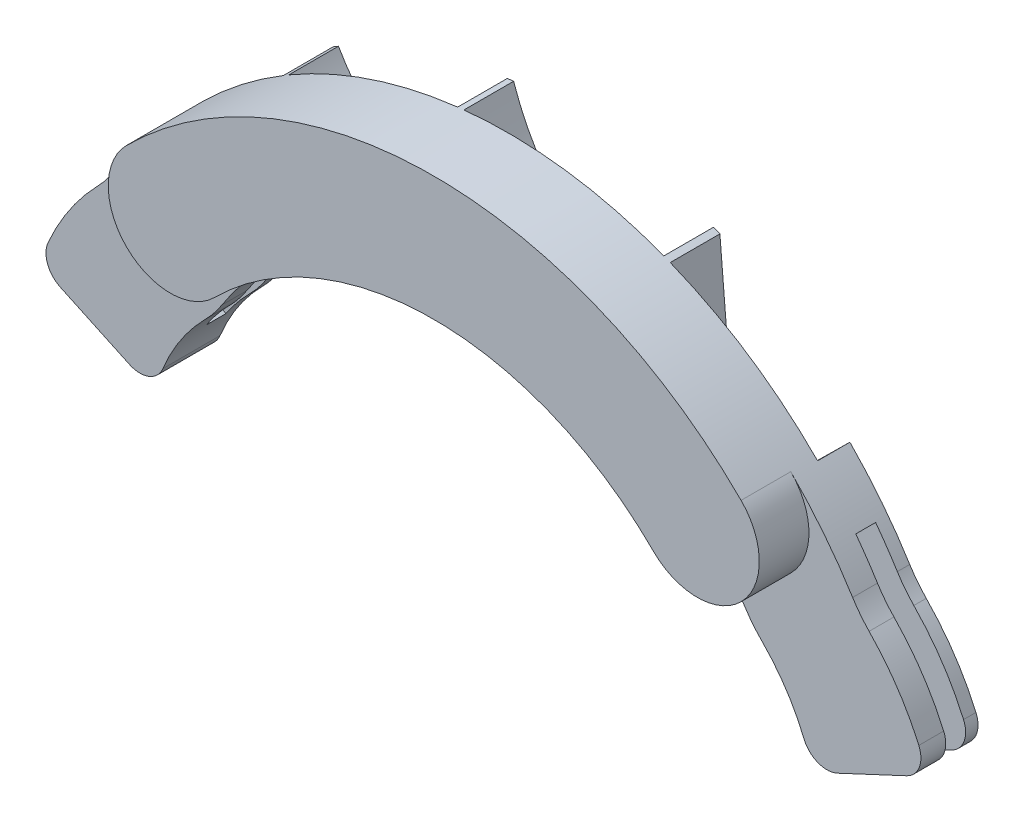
ISO-10303-21;
HEADER;
FILE_DESCRIPTION(('STEP AP214'),'2;1');
FILE_NAME('part.step','',(''),(''),'','','');
FILE_SCHEMA(('AUTOMOTIVE_DESIGN { 1 0 10303 214 1 1 1 1 }'));
ENDSEC;
DATA;
#1=APPLICATION_CONTEXT('core data for automotive mechanical design processes');
#2=APPLICATION_PROTOCOL_DEFINITION('international standard','automotive_design',2000,#1);
#3=PRODUCT_CONTEXT('',#1,'mechanical');
#4=PRODUCT('Part','Part','',(#3));
#5=PRODUCT_RELATED_PRODUCT_CATEGORY('part','',(#4));
#6=PRODUCT_DEFINITION_FORMATION('','',#4);
#7=PRODUCT_DEFINITION_CONTEXT('part definition',#1,'design');
#8=PRODUCT_DEFINITION('design','',#6,#7);
#9=PRODUCT_DEFINITION_SHAPE('','',#8);
#10=(LENGTH_UNIT() NAMED_UNIT(*) SI_UNIT(.MILLI.,.METRE.));
#11=(NAMED_UNIT(*) PLANE_ANGLE_UNIT() SI_UNIT($,.RADIAN.));
#12=(NAMED_UNIT(*) SI_UNIT($,.STERADIAN.) SOLID_ANGLE_UNIT());
#13=UNCERTAINTY_MEASURE_WITH_UNIT(LENGTH_MEASURE(1.E-05),#10,'distance_accuracy_value','');
#14=(GEOMETRIC_REPRESENTATION_CONTEXT(3) GLOBAL_UNCERTAINTY_ASSIGNED_CONTEXT((#13)) GLOBAL_UNIT_ASSIGNED_CONTEXT((#10,
#11,#12)) REPRESENTATION_CONTEXT('',''));
#15=CARTESIAN_POINT('',(0.,0.,0.));
#16=DIRECTION('',(0.,0.,1.));
#17=DIRECTION('',(1.,0.,0.));
#18=AXIS2_PLACEMENT_3D('',#15,#16,#17);
#19=CARTESIAN_POINT('',(-11.2991766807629,0.726491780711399,-2.));
#20=DIRECTION('',(0.,0.,-1.));
#21=DIRECTION('',(-1.,0.,0.));
#22=AXIS2_PLACEMENT_3D('',#19,#20,#21);
#23=PLANE('',#22);
#24=CARTESIAN_POINT('',(0.,0.,-2.));
#25=DIRECTION('',(0.,0.,1.));
#26=DIRECTION('',(-1.,0.,0.));
#27=AXIS2_PLACEMENT_3D('',#24,#25,#26);
#28=CIRCLE('',#27,25.);
#29=CARTESIAN_POINT('',(21.066964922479,13.460423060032,-2.));
#30=VERTEX_POINT('',#29);
#31=CARTESIAN_POINT('',(19.4582424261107,15.6963945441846,-2.));
#32=VERTEX_POINT('',#31);
#33=EDGE_CURVE('E627',#30,#32,#28,.T.);
#34=ORIENTED_EDGE('',*,*,#33,.T.);
#35=DIRECTION('',(-0.848048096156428,-0.529919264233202,0.));
#36=VECTOR('',#35,1.);
#37=CARTESIAN_POINT('',(19.4582424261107,15.6963945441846,-2.));
#38=LINE('',#37,#36);
#39=CARTESIAN_POINT('',(27.9826898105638,21.0230604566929,-2.));
#40=VERTEX_POINT('',#39);
#41=EDGE_CURVE('E51',#40,#32,#38,.T.);
#42=ORIENTED_EDGE('',*,*,#41,.F.);
#43=CARTESIAN_POINT('',(0.,0.,-2.));
#44=DIRECTION('',(0.,0.,-1.));
#45=DIRECTION('',(-1.,0.,0.));
#46=AXIS2_PLACEMENT_3D('',#43,#44,#45);
#47=CIRCLE('',#46,35.);
#48=CARTESIAN_POINT('',(29.7313810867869,18.4674031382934,-2.));
#49=VERTEX_POINT('',#48);
#50=EDGE_CURVE('E609',#40,#49,#47,.T.);
#51=ORIENTED_EDGE('',*,*,#50,.T.);
#52=CARTESIAN_POINT('',(38.2260613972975,23.7438040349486,-2.));
#53=DIRECTION('',(0.,0.,1.));
#54=DIRECTION('',(1.,0.,0.));
#55=AXIS2_PLACEMENT_3D('',#52,#53,#54);
#56=CIRCLE('',#55,10.);
#57=CARTESIAN_POINT('',(31.0586230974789,16.7704384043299,-2.));
#58=VERTEX_POINT('',#57);
#59=EDGE_CURVE('E612',#49,#58,#56,.T.);
#60=ORIENTED_EDGE('',*,*,#59,.T.);
#61=CARTESIAN_POINT('',(16.6707891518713,2.77218372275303,-2.));
#62=DIRECTION('',(0.,0.,-1.));
#63=DIRECTION('',(-1.,0.,0.));
#64=AXIS2_PLACEMENT_3D('',#61,#62,#63);
#65=CIRCLE('',#64,20.0738860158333);
#66=CARTESIAN_POINT('',(35.0628604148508,10.8153556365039,-2.));
#67=VERTEX_POINT('',#66);
#68=EDGE_CURVE('E615',#58,#67,#65,.T.);
#69=ORIENTED_EDGE('',*,*,#68,.T.);
#70=CARTESIAN_POINT('',(33.2304228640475,10.0139988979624,-2.));
#71=DIRECTION('',(0.,0.,-1.));
#72=DIRECTION('',(-1.,0.,0.));
#73=AXIS2_PLACEMENT_3D('',#70,#71,#72);
#74=CIRCLE('',#73,2.);
#75=CARTESIAN_POINT('',(34.0771555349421,8.20208174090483,-2.));
#76=VERTEX_POINT('',#75);
#77=EDGE_CURVE('E617',#67,#76,#74,.T.);
#78=ORIENTED_EDGE('',*,*,#77,.T.);
#79=DIRECTION('',(-0.905958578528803,-0.423366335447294,0.));
#80=VECTOR('',#79,1.);
#81=CARTESIAN_POINT('',(34.0771555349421,8.20208174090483,-2.));
#82=LINE('',#81,#80);
#83=CARTESIAN_POINT('',(28.5097797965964,5.60037398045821,-2.));
#84=VERTEX_POINT('',#83);
#85=EDGE_CURVE('E619',#76,#84,#82,.T.);
#86=ORIENTED_EDGE('',*,*,#85,.T.);
#87=CARTESIAN_POINT('',(27.6630471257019,7.41229113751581,-2.));
#88=DIRECTION('',(0.,0.,-1.));
#89=DIRECTION('',(-1.,0.,0.));
#90=AXIS2_PLACEMENT_3D('',#87,#88,#89);
#91=CIRCLE('',#90,2.);
#92=CARTESIAN_POINT('',(25.8116159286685,6.6558504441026,-2.));
#93=VERTEX_POINT('',#92);
#94=EDGE_CURVE('E621',#84,#93,#91,.T.);
#95=ORIENTED_EDGE('',*,*,#94,.T.);
#96=CARTESIAN_POINT('',(11.2991766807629,0.726491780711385,-2.));
#97=DIRECTION('',(0.,0.,1.));
#98=DIRECTION('',(1.,0.,0.));
#99=AXIS2_PLACEMENT_3D('',#96,#97,#98);
#100=CIRCLE('',#99,15.6769954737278);
#101=CARTESIAN_POINT('',(22.4078072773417,11.7884316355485,-2.));
#102=VERTEX_POINT('',#101);
#103=EDGE_CURVE('E623',#93,#102,#100,.T.);
#104=ORIENTED_EDGE('',*,*,#103,.T.);
#105=CARTESIAN_POINT('',(29.4937508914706,18.8445922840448,-2.));
#106=DIRECTION('',(0.,0.,-1.));
#107=DIRECTION('',(-1.,0.,0.));
#108=AXIS2_PLACEMENT_3D('',#105,#106,#107);
#109=CIRCLE('',#108,10.);
#110=EDGE_CURVE('E762',#102,#30,#109,.T.);
#111=ORIENTED_EDGE('',*,*,#110,.T.);
#112=EDGE_LOOP('',(#34,#42,#51,#60,#69,#78,#86,#95,#104,#111));
#113=FACE_BOUND('',#112,.T.);
#114=ADVANCED_FACE('F36',(#113),#23,.T.);
#115=CARTESIAN_POINT('',(13.0422756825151,32.4792094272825,-2.));
#116=VERTEX_POINT('',#115);
#117=CARTESIAN_POINT('',(24.9105850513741,24.5858242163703,-2.));
#118=VERTEX_POINT('',#117);
#119=EDGE_CURVE('E59',#116,#118,#47,.T.);
#120=ORIENTED_EDGE('',*,*,#119,.T.);
#121=DIRECTION('',(0.71173100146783,0.702452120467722,0.));
#122=VECTOR('',#121,1.);
#123=CARTESIAN_POINT('',(17.7932750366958,17.5613030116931,-2.));
#124=LINE('',#123,#122);
#125=CARTESIAN_POINT('',(17.7932750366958,17.5613030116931,-2.));
#126=VERTEX_POINT('',#125);
#127=EDGE_CURVE('E456',#126,#118,#124,.T.);
#128=ORIENTED_EDGE('',*,*,#127,.F.);
#129=CARTESIAN_POINT('',(14.022008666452,20.6974218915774,-2.));
#130=VERTEX_POINT('',#129);
#131=EDGE_CURVE('E630',#126,#130,#28,.T.);
#132=ORIENTED_EDGE('',*,*,#131,.T.);
#133=DIRECTION('',(-0.0828705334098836,0.996560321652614,0.));
#134=VECTOR('',#133,1.);
#135=CARTESIAN_POINT('',(15.6350188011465,1.30015446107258,-2.));
#136=LINE('',#135,#134);
#137=EDGE_CURVE('E578',#130,#116,#136,.T.);
#138=ORIENTED_EDGE('',*,*,#137,.T.);
#139=EDGE_LOOP('',(#120,#128,#132,#138));
#140=FACE_BOUND('',#139,.T.);
#141=ADVANCED_FACE('F864',(#140),#23,.T.);
#142=CARTESIAN_POINT('',(3.48389909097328,24.7560587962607,-2.));
#143=VERTEX_POINT('',#142);
#144=CARTESIAN_POINT('',(-8.95935572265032,23.3394504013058,-2.));
#145=VERTEX_POINT('',#144);
#146=EDGE_CURVE('E819',#143,#145,#28,.T.);
#147=ORIENTED_EDGE('',*,*,#146,.T.);
#148=CARTESIAN_POINT('',(-5.02419938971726,37.2952572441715,-2.));
#149=DIRECTION('',(0.,0.,-1.));
#150=DIRECTION('',(-1.,0.,0.));
#151=AXIS2_PLACEMENT_3D('',#148,#149,#150);
#152=CIRCLE('',#151,14.5);
#153=CARTESIAN_POINT('',(-17.6748425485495,30.2092691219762,-2.));
#154=VERTEX_POINT('',#153);
#155=EDGE_CURVE('E526',#154,#145,#152,.F.);
#156=ORIENTED_EDGE('',*,*,#155,.F.);
#157=CARTESIAN_POINT('',(-4.07696179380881,34.761737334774,-2.));
#158=VERTEX_POINT('',#157);
#159=EDGE_CURVE('E613',#154,#158,#47,.T.);
#160=ORIENTED_EDGE('',*,*,#159,.T.);
#161=CARTESIAN_POINT('',(14.9168522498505,41.025524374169,-2.));
#162=DIRECTION('',(0.,0.,-1.));
#163=DIRECTION('',(-1.,0.,0.));
#164=AXIS2_PLACEMENT_3D('',#161,#162,#163);
#165=CIRCLE('',#164,20.);
#166=CARTESIAN_POINT('',(3.02885520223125,24.9421315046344,-2.));
#167=VERTEX_POINT('',#166);
#168=EDGE_CURVE('E557',#158,#167,#165,.F.);
#169=ORIENTED_EDGE('',*,*,#168,.T.);
#170=CARTESIAN_POINT('',(3.62325505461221,25.7463011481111,-2.));
#171=DIRECTION('',(0.,0.,-1.));
#172=DIRECTION('',(-1.,0.,0.));
#173=AXIS2_PLACEMENT_3D('',#170,#171,#172);
#174=CIRCLE('',#173,1.);
#175=EDGE_CURVE('E747',#167,#143,#174,.F.);
#176=ORIENTED_EDGE('',*,*,#175,.T.);
#177=EDGE_LOOP('',(#147,#156,#160,#169,#176));
#178=FACE_BOUND('',#177,.T.);
#179=ADVANCED_FACE('F823',(#178),#23,.T.);
#180=CARTESIAN_POINT('',(13.8916370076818,20.7851490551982,-2.));
#181=VERTEX_POINT('',#180);
#182=CARTESIAN_POINT('',(4.38891461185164,24.6117335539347,-2.));
#183=VERTEX_POINT('',#182);
#184=EDGE_CURVE('E631',#181,#183,#28,.T.);
#185=ORIENTED_EDGE('',*,*,#184,.T.);
#186=CARTESIAN_POINT('',(14.9168522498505,41.025524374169,-2.));
#187=DIRECTION('',(0.,0.,-1.));
#188=DIRECTION('',(-1.,0.,0.));
#189=AXIS2_PLACEMENT_3D('',#186,#187,#188);
#190=CIRCLE('',#189,19.5);
#191=CARTESIAN_POINT('',(-3.56859212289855,34.8175982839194,-2.));
#192=VERTEX_POINT('',#191);
#193=EDGE_CURVE('E552',#192,#183,#190,.F.);
#194=ORIENTED_EDGE('',*,*,#193,.F.);
#195=CARTESIAN_POINT('',(12.5236285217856,32.682697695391,-2.));
#196=VERTEX_POINT('',#195);
#197=EDGE_CURVE('E867',#192,#196,#47,.T.);
#198=ORIENTED_EDGE('',*,*,#197,.T.);
#199=DIRECTION('',(-0.0828705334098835,0.996560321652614,0.));
#200=VECTOR('',#199,1.);
#201=CARTESIAN_POINT('',(15.1367386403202,1.25871919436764,-2.));
#202=LINE('',#201,#200);
#203=CARTESIAN_POINT('',(13.4507421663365,21.5336844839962,-2.));
#204=VERTEX_POINT('',#203);
#205=EDGE_CURVE('E583',#204,#196,#202,.T.);
#206=ORIENTED_EDGE('',*,*,#205,.F.);
#207=CARTESIAN_POINT('',(14.4473024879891,21.6165550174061,-2.));
#208=DIRECTION('',(0.,0.,-1.));
#209=DIRECTION('',(-1.,0.,0.));
#210=AXIS2_PLACEMENT_3D('',#207,#208,#209);
#211=CIRCLE('',#210,1.);
#212=EDGE_CURVE('E750',#204,#181,#211,.F.);
#213=ORIENTED_EDGE('',*,*,#212,.T.);
#214=EDGE_LOOP('',(#185,#194,#198,#206,#213));
#215=FACE_BOUND('',#214,.T.);
#216=ADVANCED_FACE('F845',(#215),#23,.T.);
#217=CARTESIAN_POINT('',(21.2132034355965,21.2132034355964,4.));
#218=DIRECTION('',(0.,0.,-1.));
#219=DIRECTION('',(-1.,0.,0.));
#220=AXIS2_PLACEMENT_3D('',#217,#218,#219);
#221=CYLINDRICAL_SURFACE('',#220,4.99999999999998);
#222=CARTESIAN_POINT('',(21.2132034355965,21.2132034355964,0.));
#223=DIRECTION('',(0.,0.,1.));
#224=DIRECTION('',(1.,0.,0.));
#225=AXIS2_PLACEMENT_3D('',#222,#223,#224);
#226=CIRCLE('',#225,4.99999999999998);
#227=CARTESIAN_POINT('',(17.6776695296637,17.6776695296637,0.));
#228=VERTEX_POINT('',#227);
#229=CARTESIAN_POINT('',(24.7487373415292,24.7487373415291,0.));
#230=VERTEX_POINT('',#229);
#231=EDGE_CURVE('E697',#228,#230,#226,.T.);
#232=ORIENTED_EDGE('',*,*,#231,.T.);
#233=DIRECTION('',(0.,0.,-1.));
#234=VECTOR('',#233,1.);
#235=CARTESIAN_POINT('',(24.7487373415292,24.7487373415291,4.));
#236=LINE('',#235,#234);
#237=CARTESIAN_POINT('',(24.7487373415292,24.7487373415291,4.));
#238=VERTEX_POINT('',#237);
#239=EDGE_CURVE('E721',#238,#230,#236,.T.);
#240=ORIENTED_EDGE('',*,*,#239,.F.);
#241=CARTESIAN_POINT('',(21.2132034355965,21.2132034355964,4.));
#242=DIRECTION('',(0.,0.,1.));
#243=DIRECTION('',(1.,0.,0.));
#244=AXIS2_PLACEMENT_3D('',#241,#242,#243);
#245=CIRCLE('',#244,4.99999999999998);
#246=CARTESIAN_POINT('',(17.6776695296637,17.6776695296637,4.));
#247=VERTEX_POINT('',#246);
#248=EDGE_CURVE('E698',#247,#238,#245,.T.);
#249=ORIENTED_EDGE('',*,*,#248,.F.);
#250=DIRECTION('',(0.,0.,-1.));
#251=VECTOR('',#250,1.);
#252=CARTESIAN_POINT('',(17.6776695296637,17.6776695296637,4.));
#253=LINE('',#252,#251);
#254=EDGE_CURVE('E708',#247,#228,#253,.T.);
#255=ORIENTED_EDGE('',*,*,#254,.T.);
#256=EDGE_LOOP('',(#232,#240,#249,#255));
#257=FACE_BOUND('',#256,.T.);
#258=ADVANCED_FACE('F910',(#257),#221,.T.);
#259=CARTESIAN_POINT('',(0.,0.,4.));
#260=DIRECTION('',(0.,0.,-1.));
#261=DIRECTION('',(-1.,0.,0.));
#262=AXIS2_PLACEMENT_3D('',#259,#260,#261);
#263=CYLINDRICAL_SURFACE('',#262,35.);
#264=ORIENTED_EDGE('',*,*,#239,.T.);
#265=CARTESIAN_POINT('',(0.,0.,0.));
#266=DIRECTION('',(0.,0.,-1.));
#267=DIRECTION('',(-1.,0.,0.));
#268=AXIS2_PLACEMENT_3D('',#265,#266,#267);
#269=CIRCLE('',#268,35.);
#270=CARTESIAN_POINT('',(29.7313810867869,18.4674031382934,0.));
#271=VERTEX_POINT('',#270);
#272=EDGE_CURVE('E643',#230,#271,#269,.T.);
#273=ORIENTED_EDGE('',*,*,#272,.T.);
#274=DIRECTION('',(0.,0.,1.));
#275=VECTOR('',#274,1.);
#276=CARTESIAN_POINT('',(29.7313810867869,18.4674031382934,-2.));
#277=LINE('',#276,#275);
#278=EDGE_CURVE('E676',#49,#271,#277,.T.);
#279=ORIENTED_EDGE('',*,*,#278,.F.);
#280=ORIENTED_EDGE('',*,*,#50,.F.);
#281=DIRECTION('',(0.,0.,1.));
#282=VECTOR('',#281,1.);
#283=CARTESIAN_POINT('',(27.9826898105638,21.0230604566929,-3.6));
#284=LINE('',#283,#282);
#285=CARTESIAN_POINT('',(27.9826898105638,21.0230604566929,-3.6));
#286=VERTEX_POINT('',#285);
#287=EDGE_CURVE('E466',#286,#40,#284,.T.);
#288=ORIENTED_EDGE('',*,*,#287,.F.);
#289=CARTESIAN_POINT('',(0.,0.,-3.6));
#290=DIRECTION('',(0.,0.,-1.));
#291=DIRECTION('',(-1.,0.,0.));
#292=AXIS2_PLACEMENT_3D('',#289,#290,#291);
#293=CIRCLE('',#292,35.);
#294=CARTESIAN_POINT('',(29.7313810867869,18.4674031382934,-3.6));
#295=VERTEX_POINT('',#294);
#296=EDGE_CURVE('E390',#286,#295,#293,.T.);
#297=ORIENTED_EDGE('',*,*,#296,.T.);
#298=DIRECTION('',(0.,0.,1.));
#299=VECTOR('',#298,1.);
#300=CARTESIAN_POINT('',(29.7313810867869,18.4674031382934,-4.6));
#301=LINE('',#300,#299);
#302=CARTESIAN_POINT('',(29.7313810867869,18.4674031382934,-4.6));
#303=VERTEX_POINT('',#302);
#304=EDGE_CURVE('E385',#303,#295,#301,.T.);
#305=ORIENTED_EDGE('',*,*,#304,.F.);
#306=CARTESIAN_POINT('',(0.,0.,-4.6));
#307=DIRECTION('',(0.,0.,-1.));
#308=DIRECTION('',(-1.,0.,0.));
#309=AXIS2_PLACEMENT_3D('',#306,#307,#308);
#310=CIRCLE('',#309,35.);
#311=CARTESIAN_POINT('',(24.9105850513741,24.5858242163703,-4.6));
#312=VERTEX_POINT('',#311);
#313=EDGE_CURVE('E371',#312,#303,#310,.T.);
#314=ORIENTED_EDGE('',*,*,#313,.F.);
#315=DIRECTION('',(0.,0.,1.));
#316=VECTOR('',#315,1.);
#317=CARTESIAN_POINT('',(24.9105850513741,24.5858242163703,-3.6));
#318=LINE('',#317,#316);
#319=EDGE_CURVE('E455',#312,#118,#318,.T.);
#320=ORIENTED_EDGE('',*,*,#319,.T.);
#321=ORIENTED_EDGE('',*,*,#119,.F.);
#322=DIRECTION('',(0.,0.,1.));
#323=VECTOR('',#322,1.);
#324=CARTESIAN_POINT('',(13.0422756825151,32.4792094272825,-6.));
#325=LINE('',#324,#323);
#326=CARTESIAN_POINT('',(13.0422756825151,32.4792094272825,-6.));
#327=VERTEX_POINT('',#326);
#328=EDGE_CURVE('E590',#327,#116,#325,.T.);
#329=ORIENTED_EDGE('',*,*,#328,.F.);
#330=CARTESIAN_POINT('',(0.,0.,-6.));
#331=DIRECTION('',(0.,0.,-1.));
#332=DIRECTION('',(-1.,0.,0.));
#333=AXIS2_PLACEMENT_3D('',#330,#331,#332);
#334=CIRCLE('',#333,35.);
#335=CARTESIAN_POINT('',(12.5236285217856,32.682697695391,-6.));
#336=VERTEX_POINT('',#335);
#337=EDGE_CURVE('E588',#336,#327,#334,.T.);
#338=ORIENTED_EDGE('',*,*,#337,.F.);
#339=DIRECTION('',(0.,0.,1.));
#340=VECTOR('',#339,1.);
#341=CARTESIAN_POINT('',(12.5236285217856,32.682697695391,-6.));
#342=LINE('',#341,#340);
#343=EDGE_CURVE('E595',#336,#196,#342,.T.);
#344=ORIENTED_EDGE('',*,*,#343,.T.);
#345=ORIENTED_EDGE('',*,*,#197,.F.);
#346=DIRECTION('',(0.,0.,1.));
#347=VECTOR('',#346,1.);
#348=CARTESIAN_POINT('',(-3.56859212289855,34.8175982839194,-6.));
#349=LINE('',#348,#347);
#350=CARTESIAN_POINT('',(-3.56859212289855,34.8175982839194,-6.));
#351=VERTEX_POINT('',#350);
#352=EDGE_CURVE('E575',#351,#192,#349,.T.);
#353=ORIENTED_EDGE('',*,*,#352,.F.);
#354=CARTESIAN_POINT('',(0.,0.,-6.));
#355=DIRECTION('',(0.,0.,-1.));
#356=DIRECTION('',(-1.,0.,0.));
#357=AXIS2_PLACEMENT_3D('',#354,#355,#356);
#358=CIRCLE('',#357,35.);
#359=CARTESIAN_POINT('',(-4.07696179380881,34.761737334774,-6.));
#360=VERTEX_POINT('',#359);
#361=EDGE_CURVE('E553',#360,#351,#358,.T.);
#362=ORIENTED_EDGE('',*,*,#361,.F.);
#363=DIRECTION('',(0.,0.,1.));
#364=VECTOR('',#363,1.);
#365=CARTESIAN_POINT('',(-4.07696179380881,34.761737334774,-6.));
#366=LINE('',#365,#364);
#367=EDGE_CURVE('E565',#360,#158,#366,.T.);
#368=ORIENTED_EDGE('',*,*,#367,.T.);
#369=ORIENTED_EDGE('',*,*,#159,.F.);
#370=DIRECTION('',(0.,0.,1.));
#371=VECTOR('',#370,1.);
#372=CARTESIAN_POINT('',(-17.6748425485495,30.2092691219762,-6.));
#373=LINE('',#372,#371);
#374=CARTESIAN_POINT('',(-17.6748425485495,30.2092691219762,-6.));
#375=VERTEX_POINT('',#374);
#376=EDGE_CURVE('E549',#375,#154,#373,.T.);
#377=ORIENTED_EDGE('',*,*,#376,.F.);
#378=CARTESIAN_POINT('',(0.,0.,-6.));
#379=DIRECTION('',(0.,0.,-1.));
#380=DIRECTION('',(-1.,0.,0.));
#381=AXIS2_PLACEMENT_3D('',#378,#379,#380);
#382=CIRCLE('',#381,35.);
#383=CARTESIAN_POINT('',(-18.104728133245,29.953611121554,-6.));
#384=VERTEX_POINT('',#383);
#385=EDGE_CURVE('E527',#384,#375,#382,.T.);
#386=ORIENTED_EDGE('',*,*,#385,.F.);
#387=DIRECTION('',(0.,0.,1.));
#388=VECTOR('',#387,1.);
#389=CARTESIAN_POINT('',(-18.104728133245,29.953611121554,-6.));
#390=LINE('',#389,#388);
#391=CARTESIAN_POINT('',(-18.104728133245,29.953611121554,-2.));
#392=VERTEX_POINT('',#391);
#393=EDGE_CURVE('E539',#384,#392,#390,.T.);
#394=ORIENTED_EDGE('',*,*,#393,.T.);
#395=CARTESIAN_POINT('',(-29.7313810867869,18.4674031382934,-2.));
#396=VERTEX_POINT('',#395);
#397=EDGE_CURVE('E610',#396,#392,#47,.T.);
#398=ORIENTED_EDGE('',*,*,#397,.F.);
#399=DIRECTION('',(0.,0.,1.));
#400=VECTOR('',#399,1.);
#401=CARTESIAN_POINT('',(-29.7313810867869,18.4674031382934,-2.));
#402=LINE('',#401,#400);
#403=CARTESIAN_POINT('',(-29.7313810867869,18.4674031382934,0.));
#404=VERTEX_POINT('',#403);
#405=EDGE_CURVE('E679',#396,#404,#402,.T.);
#406=ORIENTED_EDGE('',*,*,#405,.T.);
#407=CARTESIAN_POINT('',(-24.7487373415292,24.7487373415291,0.));
#408=VERTEX_POINT('',#407);
#409=EDGE_CURVE('E644',#404,#408,#269,.T.);
#410=ORIENTED_EDGE('',*,*,#409,.T.);
#411=DIRECTION('',(0.,0.,-1.));
#412=VECTOR('',#411,1.);
#413=CARTESIAN_POINT('',(-24.7487373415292,24.7487373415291,4.));
#414=LINE('',#413,#412);
#415=CARTESIAN_POINT('',(-24.7487373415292,24.7487373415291,4.));
#416=VERTEX_POINT('',#415);
#417=EDGE_CURVE('E718',#416,#408,#414,.T.);
#418=ORIENTED_EDGE('',*,*,#417,.F.);
#419=CARTESIAN_POINT('',(0.,0.,4.));
#420=DIRECTION('',(0.,0.,1.));
#421=DIRECTION('',(1.,0.,0.));
#422=AXIS2_PLACEMENT_3D('',#419,#420,#421);
#423=CIRCLE('',#422,35.);
#424=EDGE_CURVE('E701',#238,#416,#423,.T.);
#425=ORIENTED_EDGE('',*,*,#424,.F.);
#426=EDGE_LOOP('',(#264,#273,#279,#280,#288,#297,#305,#314,#320,#321,#329,#338,#344,#345,#353,
#362,#368,#369,#377,#386,#394,#398,#406,#410,#418,#425));
#427=FACE_BOUND('',#426,.T.);
#428=ADVANCED_FACE('F387',(#427),#263,.T.);
#429=CARTESIAN_POINT('',(-21.2132034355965,21.2132034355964,4.));
#430=DIRECTION('',(0.,0.,-1.));
#431=DIRECTION('',(-1.,0.,0.));
#432=AXIS2_PLACEMENT_3D('',#429,#430,#431);
#433=CYLINDRICAL_SURFACE('',#432,4.99999999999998);
#434=CARTESIAN_POINT('',(-21.2132034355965,21.2132034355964,0.));
#435=DIRECTION('',(0.,0.,1.));
#436=DIRECTION('',(1.,0.,0.));
#437=AXIS2_PLACEMENT_3D('',#434,#435,#436);
#438=CIRCLE('',#437,4.99999999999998);
#439=CARTESIAN_POINT('',(-17.6776695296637,17.6776695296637,0.));
#440=VERTEX_POINT('',#439);
#441=EDGE_CURVE('E702',#408,#440,#438,.T.);
#442=ORIENTED_EDGE('',*,*,#441,.T.);
#443=DIRECTION('',(0.,0.,-1.));
#444=VECTOR('',#443,1.);
#445=CARTESIAN_POINT('',(-17.6776695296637,17.6776695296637,4.));
#446=LINE('',#445,#444);
#447=CARTESIAN_POINT('',(-17.6776695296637,17.6776695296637,4.));
#448=VERTEX_POINT('',#447);
#449=EDGE_CURVE('E715',#448,#440,#446,.T.);
#450=ORIENTED_EDGE('',*,*,#449,.F.);
#451=CARTESIAN_POINT('',(-21.2132034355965,21.2132034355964,4.));
#452=DIRECTION('',(0.,0.,1.));
#453=DIRECTION('',(1.,0.,0.));
#454=AXIS2_PLACEMENT_3D('',#451,#452,#453);
#455=CIRCLE('',#454,4.99999999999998);
#456=EDGE_CURVE('E704',#416,#448,#455,.T.);
#457=ORIENTED_EDGE('',*,*,#456,.F.);
#458=ORIENTED_EDGE('',*,*,#417,.T.);
#459=EDGE_LOOP('',(#442,#450,#457,#458));
#460=FACE_BOUND('',#459,.T.);
#461=ADVANCED_FACE('F916',(#460),#433,.T.);
#462=CARTESIAN_POINT('',(0.,0.,4.));
#463=DIRECTION('',(0.,0.,-1.));
#464=DIRECTION('',(-1.,0.,0.));
#465=AXIS2_PLACEMENT_3D('',#462,#463,#464);
#466=CYLINDRICAL_SURFACE('',#465,25.);
#467=ORIENTED_EDGE('',*,*,#33,.F.);
#468=DIRECTION('',(0.,0.,-1.));
#469=VECTOR('',#468,1.);
#470=CARTESIAN_POINT('',(21.066964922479,13.460423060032,4.));
#471=LINE('',#470,#469);
#472=CARTESIAN_POINT('',(21.066964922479,13.460423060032,0.));
#473=VERTEX_POINT('',#472);
#474=EDGE_CURVE('E755',#30,#473,#471,.F.);
#475=ORIENTED_EDGE('',*,*,#474,.T.);
#476=CARTESIAN_POINT('',(0.,0.,0.));
#477=DIRECTION('',(0.,0.,1.));
#478=DIRECTION('',(-1.,0.,0.));
#479=AXIS2_PLACEMENT_3D('',#476,#477,#478);
#480=CIRCLE('',#479,25.);
#481=EDGE_CURVE('E605',#473,#228,#480,.T.);
#482=ORIENTED_EDGE('',*,*,#481,.T.);
#483=ORIENTED_EDGE('',*,*,#254,.F.);
#484=CARTESIAN_POINT('',(0.,0.,4.));
#485=DIRECTION('',(0.,0.,-1.));
#486=DIRECTION('',(1.,0.,0.));
#487=AXIS2_PLACEMENT_3D('',#484,#485,#486);
#488=CIRCLE('',#487,25.);
#489=EDGE_CURVE('E706',#448,#247,#488,.T.);
#490=ORIENTED_EDGE('',*,*,#489,.F.);
#491=ORIENTED_EDGE('',*,*,#449,.T.);
#492=CARTESIAN_POINT('',(-21.066964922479,13.460423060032,0.));
#493=VERTEX_POINT('',#492);
#494=EDGE_CURVE('E660',#440,#493,#480,.T.);
#495=ORIENTED_EDGE('',*,*,#494,.T.);
#496=DIRECTION('',(0.,0.,-1.));
#497=VECTOR('',#496,1.);
#498=CARTESIAN_POINT('',(-21.066964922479,13.460423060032,4.));
#499=LINE('',#498,#497);
#500=CARTESIAN_POINT('',(-21.066964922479,13.460423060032,-2.));
#501=VERTEX_POINT('',#500);
#502=EDGE_CURVE('E753',#493,#501,#499,.T.);
#503=ORIENTED_EDGE('',*,*,#502,.T.);
#504=CARTESIAN_POINT('',(-9.35689938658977,23.1829341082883,-2.));
#505=VERTEX_POINT('',#504);
#506=EDGE_CURVE('E626',#505,#501,#28,.T.);
#507=ORIENTED_EDGE('',*,*,#506,.F.);
#508=DIRECTION('',(0.,0.,-1.));
#509=VECTOR('',#508,1.);
#510=CARTESIAN_POINT('',(-9.35689938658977,23.1829341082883,4.));
#511=LINE('',#510,#509);
#512=CARTESIAN_POINT('',(-9.35689938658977,23.1829341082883,-6.));
#513=VERTEX_POINT('',#512);
#514=EDGE_CURVE('E730',#505,#513,#511,.T.);
#515=ORIENTED_EDGE('',*,*,#514,.T.);
#516=CARTESIAN_POINT('',(0.,0.,-6.));
#517=DIRECTION('',(0.,0.,-1.));
#518=DIRECTION('',(-1.,0.,0.));
#519=AXIS2_PLACEMENT_3D('',#516,#517,#518);
#520=CIRCLE('',#519,25.);
#521=CARTESIAN_POINT('',(-8.95935572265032,23.3394504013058,-6.));
#522=VERTEX_POINT('',#521);
#523=EDGE_CURVE('E533',#522,#513,#520,.F.);
#524=ORIENTED_EDGE('',*,*,#523,.F.);
#525=DIRECTION('',(0.,0.,1.));
#526=VECTOR('',#525,1.);
#527=CARTESIAN_POINT('',(-8.95935572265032,23.3394504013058,-6.));
#528=LINE('',#527,#526);
#529=EDGE_CURVE('E546',#522,#145,#528,.T.);
#530=ORIENTED_EDGE('',*,*,#529,.T.);
#531=ORIENTED_EDGE('',*,*,#146,.F.);
#532=DIRECTION('',(0.,0.,-1.));
#533=VECTOR('',#532,1.);
#534=CARTESIAN_POINT('',(3.48389909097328,24.7560587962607,4.));
#535=LINE('',#534,#533);
#536=CARTESIAN_POINT('',(3.48389909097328,24.7560587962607,-6.));
#537=VERTEX_POINT('',#536);
#538=EDGE_CURVE('E728',#143,#537,#535,.T.);
#539=ORIENTED_EDGE('',*,*,#538,.T.);
#540=CARTESIAN_POINT('',(0.,0.,-6.));
#541=DIRECTION('',(0.,0.,-1.));
#542=DIRECTION('',(-1.,0.,0.));
#543=AXIS2_PLACEMENT_3D('',#540,#541,#542);
#544=CIRCLE('',#543,25.);
#545=CARTESIAN_POINT('',(4.38891461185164,24.6117335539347,-6.));
#546=VERTEX_POINT('',#545);
#547=EDGE_CURVE('E559',#546,#537,#544,.F.);
#548=ORIENTED_EDGE('',*,*,#547,.F.);
#549=DIRECTION('',(0.,0.,1.));
#550=VECTOR('',#549,1.);
#551=CARTESIAN_POINT('',(4.38891461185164,24.6117335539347,-6.));
#552=LINE('',#551,#550);
#553=EDGE_CURVE('E572',#546,#183,#552,.T.);
#554=ORIENTED_EDGE('',*,*,#553,.T.);
#555=ORIENTED_EDGE('',*,*,#184,.F.);
#556=DIRECTION('',(0.,0.,-1.));
#557=VECTOR('',#556,1.);
#558=CARTESIAN_POINT('',(13.8916370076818,20.7851490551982,4.));
#559=LINE('',#558,#557);
#560=CARTESIAN_POINT('',(13.8916370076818,20.7851490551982,-6.));
#561=VERTEX_POINT('',#560);
#562=EDGE_CURVE('E726',#181,#561,#559,.T.);
#563=ORIENTED_EDGE('',*,*,#562,.T.);
#564=CARTESIAN_POINT('',(0.,0.,-6.));
#565=DIRECTION('',(0.,0.,-1.));
#566=DIRECTION('',(-1.,0.,0.));
#567=AXIS2_PLACEMENT_3D('',#564,#565,#566);
#568=CIRCLE('',#567,25.);
#569=CARTESIAN_POINT('',(14.022008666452,20.6974218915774,-6.));
#570=VERTEX_POINT('',#569);
#571=EDGE_CURVE('E582',#570,#561,#568,.F.);
#572=ORIENTED_EDGE('',*,*,#571,.F.);
#573=DIRECTION('',(0.,0.,1.));
#574=VECTOR('',#573,1.);
#575=CARTESIAN_POINT('',(14.022008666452,20.6974218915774,-6.));
#576=LINE('',#575,#574);
#577=EDGE_CURVE('E598',#570,#130,#576,.T.);
#578=ORIENTED_EDGE('',*,*,#577,.T.);
#579=ORIENTED_EDGE('',*,*,#131,.F.);
#580=DIRECTION('',(0.,0.,1.));
#581=VECTOR('',#580,1.);
#582=CARTESIAN_POINT('',(17.7932750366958,17.5613030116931,-3.6));
#583=LINE('',#582,#581);
#584=CARTESIAN_POINT('',(17.7932750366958,17.5613030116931,-4.6));
#585=VERTEX_POINT('',#584);
#586=EDGE_CURVE('E460',#585,#126,#583,.T.);
#587=ORIENTED_EDGE('',*,*,#586,.F.);
#588=CARTESIAN_POINT('',(0.,0.,-4.6));
#589=DIRECTION('',(0.,0.,1.));
#590=DIRECTION('',(-1.,0.,0.));
#591=AXIS2_PLACEMENT_3D('',#588,#589,#590);
#592=CIRCLE('',#591,25.);
#593=CARTESIAN_POINT('',(21.066964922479,13.460423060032,-4.6));
#594=VERTEX_POINT('',#593);
#595=EDGE_CURVE('E412',#594,#585,#592,.T.);
#596=ORIENTED_EDGE('',*,*,#595,.F.);
#597=DIRECTION('',(0.,0.,1.));
#598=VECTOR('',#597,1.);
#599=CARTESIAN_POINT('',(21.066964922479,13.460423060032,-4.6));
#600=LINE('',#599,#598);
#601=CARTESIAN_POINT('',(21.066964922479,13.460423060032,-3.6));
#602=VERTEX_POINT('',#601);
#603=EDGE_CURVE('E415',#594,#602,#600,.T.);
#604=ORIENTED_EDGE('',*,*,#603,.T.);
#605=CARTESIAN_POINT('',(0.,0.,-3.6));
#606=DIRECTION('',(0.,0.,1.));
#607=DIRECTION('',(-1.,0.,0.));
#608=AXIS2_PLACEMENT_3D('',#605,#606,#607);
#609=CIRCLE('',#608,25.);
#610=CARTESIAN_POINT('',(19.4582424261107,15.6963945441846,-3.6));
#611=VERTEX_POINT('',#610);
#612=EDGE_CURVE('E382',#602,#611,#609,.T.);
#613=ORIENTED_EDGE('',*,*,#612,.T.);
#614=DIRECTION('',(0.,0.,1.));
#615=VECTOR('',#614,1.);
#616=CARTESIAN_POINT('',(19.4582424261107,15.6963945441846,-3.6));
#617=LINE('',#616,#615);
#618=EDGE_CURVE('E463',#611,#32,#617,.T.);
#619=ORIENTED_EDGE('',*,*,#618,.T.);
#620=EDGE_LOOP('',(#467,#475,#482,#483,#490,#491,#495,#503,#507,#515,#524,#530,#531,#539,#548,
#554,#555,#563,#572,#578,#579,#587,#596,#604,#613,#619));
#621=FACE_BOUND('',#620,.T.);
#622=ADVANCED_FACE('F776',(#621),#466,.F.);
#623=CARTESIAN_POINT('',(10.6066017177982,10.6066017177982,4.));
#624=DIRECTION('',(0.,0.,1.));
#625=DIRECTION('',(1.,0.,0.));
#626=AXIS2_PLACEMENT_3D('',#623,#624,#625);
#627=PLANE('',#626);
#628=ORIENTED_EDGE('',*,*,#248,.T.);
#629=ORIENTED_EDGE('',*,*,#424,.T.);
#630=ORIENTED_EDGE('',*,*,#456,.T.);
#631=ORIENTED_EDGE('',*,*,#489,.T.);
#632=EDGE_LOOP('',(#628,#629,#630,#631));
#633=FACE_BOUND('',#632,.T.);
#634=ADVANCED_FACE('F912',(#633),#627,.T.);
#635=CARTESIAN_POINT('',(-11.2991766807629,0.726491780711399,0.));
#636=DIRECTION('',(0.,0.,-1.));
#637=DIRECTION('',(-1.,0.,0.));
#638=AXIS2_PLACEMENT_3D('',#635,#636,#637);
#639=PLANE('',#638);
#640=ORIENTED_EDGE('',*,*,#481,.F.);
#641=CARTESIAN_POINT('',(29.4937508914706,18.8445922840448,0.));
#642=DIRECTION('',(0.,0.,-1.));
#643=DIRECTION('',(-1.,0.,0.));
#644=AXIS2_PLACEMENT_3D('',#641,#642,#643);
#645=CIRCLE('',#644,10.);
#646=CARTESIAN_POINT('',(22.4078072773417,11.7884316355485,0.));
#647=VERTEX_POINT('',#646);
#648=EDGE_CURVE('E758',#473,#647,#645,.F.);
#649=ORIENTED_EDGE('',*,*,#648,.T.);
#650=CARTESIAN_POINT('',(11.2991766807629,0.726491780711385,0.));
#651=DIRECTION('',(0.,0.,1.));
#652=DIRECTION('',(1.,0.,0.));
#653=AXIS2_PLACEMENT_3D('',#650,#651,#652);
#654=CIRCLE('',#653,15.6769954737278);
#655=CARTESIAN_POINT('',(25.8116159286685,6.6558504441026,0.));
#656=VERTEX_POINT('',#655);
#657=EDGE_CURVE('E657',#656,#647,#654,.T.);
#658=ORIENTED_EDGE('',*,*,#657,.F.);
#659=CARTESIAN_POINT('',(27.6630471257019,7.41229113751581,0.));
#660=DIRECTION('',(0.,0.,-1.));
#661=DIRECTION('',(-1.,0.,0.));
#662=AXIS2_PLACEMENT_3D('',#659,#660,#661);
#663=CIRCLE('',#662,2.);
#664=CARTESIAN_POINT('',(28.5097797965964,5.60037398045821,0.));
#665=VERTEX_POINT('',#664);
#666=EDGE_CURVE('E655',#665,#656,#663,.T.);
#667=ORIENTED_EDGE('',*,*,#666,.F.);
#668=DIRECTION('',(-0.905958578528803,-0.423366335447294,0.));
#669=VECTOR('',#668,1.);
#670=CARTESIAN_POINT('',(34.0771555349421,8.20208174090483,0.));
#671=LINE('',#670,#669);
#672=CARTESIAN_POINT('',(34.0771555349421,8.20208174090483,0.));
#673=VERTEX_POINT('',#672);
#674=EDGE_CURVE('E653',#673,#665,#671,.T.);
#675=ORIENTED_EDGE('',*,*,#674,.F.);
#676=CARTESIAN_POINT('',(33.2304228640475,10.0139988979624,0.));
#677=DIRECTION('',(0.,0.,-1.));
#678=DIRECTION('',(-1.,0.,0.));
#679=AXIS2_PLACEMENT_3D('',#676,#677,#678);
#680=CIRCLE('',#679,2.);
#681=CARTESIAN_POINT('',(35.0628604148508,10.8153556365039,0.));
#682=VERTEX_POINT('',#681);
#683=EDGE_CURVE('E651',#682,#673,#680,.T.);
#684=ORIENTED_EDGE('',*,*,#683,.F.);
#685=CARTESIAN_POINT('',(16.6707891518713,2.77218372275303,0.));
#686=DIRECTION('',(0.,0.,-1.));
#687=DIRECTION('',(-1.,0.,0.));
#688=AXIS2_PLACEMENT_3D('',#685,#686,#687);
#689=CIRCLE('',#688,20.0738860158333);
#690=CARTESIAN_POINT('',(31.0586230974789,16.7704384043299,0.));
#691=VERTEX_POINT('',#690);
#692=EDGE_CURVE('E649',#691,#682,#689,.T.);
#693=ORIENTED_EDGE('',*,*,#692,.F.);
#694=CARTESIAN_POINT('',(38.2260613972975,23.7438040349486,0.));
#695=DIRECTION('',(0.,0.,1.));
#696=DIRECTION('',(1.,0.,0.));
#697=AXIS2_PLACEMENT_3D('',#694,#695,#696);
#698=CIRCLE('',#697,10.);
#699=EDGE_CURVE('E647',#271,#691,#698,.T.);
#700=ORIENTED_EDGE('',*,*,#699,.F.);
#701=ORIENTED_EDGE('',*,*,#272,.F.);
#702=ORIENTED_EDGE('',*,*,#231,.F.);
#703=EDGE_LOOP('',(#640,#649,#658,#667,#675,#684,#693,#700,#701,#702));
#704=FACE_BOUND('',#703,.T.);
#705=ADVANCED_FACE('F905',(#704),#639,.F.);
#706=CARTESIAN_POINT('',(-11.2991766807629,0.726491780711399,-2.));
#707=DIRECTION('',(0.,0.,1.));
#708=DIRECTION('',(1.,0.,0.));
#709=AXIS2_PLACEMENT_3D('',#706,#707,#708);
#710=CYLINDRICAL_SURFACE('',#709,15.6769954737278);
#711=CARTESIAN_POINT('',(-11.2991766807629,0.726491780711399,-2.));
#712=DIRECTION('',(0.,0.,1.));
#713=DIRECTION('',(-1.,0.,0.));
#714=AXIS2_PLACEMENT_3D('',#711,#712,#713);
#715=CIRCLE('',#714,15.6769954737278);
#716=CARTESIAN_POINT('',(-22.4078072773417,11.7884316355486,-2.));
#717=VERTEX_POINT('',#716);
#718=CARTESIAN_POINT('',(-24.3382858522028,9.42992898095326,-2.));
#719=VERTEX_POINT('',#718);
#720=EDGE_CURVE('E602',#717,#719,#715,.T.);
#721=ORIENTED_EDGE('',*,*,#720,.F.);
#722=DIRECTION('',(0.,0.,1.));
#723=VECTOR('',#722,1.);
#724=CARTESIAN_POINT('',(-22.4078072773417,11.7884316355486,-2.));
#725=LINE('',#724,#723);
#726=CARTESIAN_POINT('',(-22.4078072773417,11.7884316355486,0.));
#727=VERTEX_POINT('',#726);
#728=EDGE_CURVE('E764',#717,#727,#725,.T.);
#729=ORIENTED_EDGE('',*,*,#728,.T.);
#730=CARTESIAN_POINT('',(-11.2991766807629,0.726491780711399,0.));
#731=DIRECTION('',(0.,0.,1.));
#732=DIRECTION('',(-1.,0.,0.));
#733=AXIS2_PLACEMENT_3D('',#730,#731,#732);
#734=CIRCLE('',#733,15.6769954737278);
#735=CARTESIAN_POINT('',(-25.8116159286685,6.6558504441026,0.));
#736=VERTEX_POINT('',#735);
#737=EDGE_CURVE('E601',#727,#736,#734,.T.);
#738=ORIENTED_EDGE('',*,*,#737,.T.);
#739=DIRECTION('',(0.,0.,1.));
#740=VECTOR('',#739,1.);
#741=CARTESIAN_POINT('',(-25.8116159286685,6.6558504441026,-2.));
#742=LINE('',#741,#740);
#743=CARTESIAN_POINT('',(-25.8116159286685,6.6558504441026,-4.6));
#744=VERTEX_POINT('',#743);
#745=EDGE_CURVE('E694',#744,#736,#742,.T.);
#746=ORIENTED_EDGE('',*,*,#745,.F.);
#747=CARTESIAN_POINT('',(-11.2991766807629,0.726491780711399,-4.6));
#748=DIRECTION('',(0.,0.,1.));
#749=DIRECTION('',(-1.,0.,0.));
#750=AXIS2_PLACEMENT_3D('',#747,#748,#749);
#751=CIRCLE('',#750,15.6769954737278);
#752=CARTESIAN_POINT('',(-22.4078072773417,11.7884316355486,-4.6));
#753=VERTEX_POINT('',#752);
#754=EDGE_CURVE('E480',#753,#744,#751,.T.);
#755=ORIENTED_EDGE('',*,*,#754,.F.);
#756=DIRECTION('',(0.,0.,1.));
#757=VECTOR('',#756,1.);
#758=CARTESIAN_POINT('',(-22.4078072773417,11.7884316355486,-4.6));
#759=LINE('',#758,#757);
#760=CARTESIAN_POINT('',(-22.4078072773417,11.7884316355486,-3.6));
#761=VERTEX_POINT('',#760);
#762=EDGE_CURVE('E492',#753,#761,#759,.T.);
#763=ORIENTED_EDGE('',*,*,#762,.T.);
#764=CARTESIAN_POINT('',(-11.2991766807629,0.726491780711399,-3.6));
#765=DIRECTION('',(0.,0.,1.));
#766=DIRECTION('',(-1.,0.,0.));
#767=AXIS2_PLACEMENT_3D('',#764,#765,#766);
#768=CIRCLE('',#767,15.6769954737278);
#769=CARTESIAN_POINT('',(-24.3382858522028,9.42992898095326,-3.6));
#770=VERTEX_POINT('',#769);
#771=EDGE_CURVE('E499',#761,#770,#768,.T.);
#772=ORIENTED_EDGE('',*,*,#771,.T.);
#773=DIRECTION('',(0.,0.,1.));
#774=VECTOR('',#773,1.);
#775=CARTESIAN_POINT('',(-24.3382858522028,9.42992898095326,-3.6));
#776=LINE('',#775,#774);
#777=EDGE_CURVE('E523',#770,#719,#776,.T.);
#778=ORIENTED_EDGE('',*,*,#777,.T.);
#779=EDGE_LOOP('',(#721,#729,#738,#746,#755,#763,#772,#778));
#780=FACE_BOUND('',#779,.T.);
#781=ADVANCED_FACE('F785',(#780),#710,.F.);
#782=CARTESIAN_POINT('',(-27.6630471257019,7.41229113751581,-2.));
#783=DIRECTION('',(0.,0.,1.));
#784=DIRECTION('',(1.,0.,0.));
#785=AXIS2_PLACEMENT_3D('',#782,#783,#784);
#786=CYLINDRICAL_SURFACE('',#785,2.);
#787=CARTESIAN_POINT('',(-27.6630471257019,7.41229113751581,0.));
#788=DIRECTION('',(0.,0.,-1.));
#789=DIRECTION('',(1.,0.,0.));
#790=AXIS2_PLACEMENT_3D('',#787,#788,#789);
#791=CIRCLE('',#790,2.);
#792=CARTESIAN_POINT('',(-28.5097797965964,5.60037398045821,0.));
#793=VERTEX_POINT('',#792);
#794=EDGE_CURVE('E633',#736,#793,#791,.T.);
#795=ORIENTED_EDGE('',*,*,#794,.T.);
#796=DIRECTION('',(0.,0.,1.));
#797=VECTOR('',#796,1.);
#798=CARTESIAN_POINT('',(-28.5097797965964,5.60037398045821,-2.));
#799=LINE('',#798,#797);
#800=CARTESIAN_POINT('',(-28.5097797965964,5.60037398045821,-4.6));
#801=VERTEX_POINT('',#800);
#802=EDGE_CURVE('E691',#801,#793,#799,.T.);
#803=ORIENTED_EDGE('',*,*,#802,.F.);
#804=CARTESIAN_POINT('',(-27.6630471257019,7.41229113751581,-4.6));
#805=DIRECTION('',(0.,0.,-1.));
#806=DIRECTION('',(-1.,0.,0.));
#807=AXIS2_PLACEMENT_3D('',#804,#805,#806);
#808=CIRCLE('',#807,2.);
#809=EDGE_CURVE('E483',#744,#801,#808,.T.);
#810=ORIENTED_EDGE('',*,*,#809,.F.);
#811=ORIENTED_EDGE('',*,*,#745,.T.);
#812=EDGE_LOOP('',(#795,#803,#810,#811));
#813=FACE_BOUND('',#812,.T.);
#814=ADVANCED_FACE('F931',(#813),#786,.T.);
#815=CARTESIAN_POINT('',(-34.0771555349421,8.20208174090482,-2.));
#816=DIRECTION('',(0.423366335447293,0.905958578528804,0.));
#817=DIRECTION('',(-0.905958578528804,0.423366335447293,0.));
#818=AXIS2_PLACEMENT_3D('',#815,#816,#817);
#819=PLANE('',#818);
#820=DIRECTION('',(-0.905958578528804,0.423366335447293,0.));
#821=VECTOR('',#820,1.);
#822=CARTESIAN_POINT('',(-34.0771555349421,8.20208174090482,0.));
#823=LINE('',#822,#821);
#824=CARTESIAN_POINT('',(-34.0771555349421,8.20208174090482,0.));
#825=VERTEX_POINT('',#824);
#826=EDGE_CURVE('E635',#793,#825,#823,.T.);
#827=ORIENTED_EDGE('',*,*,#826,.T.);
#828=DIRECTION('',(0.,0.,1.));
#829=VECTOR('',#828,1.);
#830=CARTESIAN_POINT('',(-34.0771555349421,8.20208174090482,-2.));
#831=LINE('',#830,#829);
#832=CARTESIAN_POINT('',(-34.0771555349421,8.20208174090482,-4.6));
#833=VERTEX_POINT('',#832);
#834=EDGE_CURVE('E688',#833,#825,#831,.T.);
#835=ORIENTED_EDGE('',*,*,#834,.F.);
#836=DIRECTION('',(-0.905958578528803,0.423366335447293,0.));
#837=VECTOR('',#836,1.);
#838=CARTESIAN_POINT('',(-28.5097797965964,5.60037398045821,-4.6));
#839=LINE('',#838,#837);
#840=EDGE_CURVE('E486',#801,#833,#839,.T.);
#841=ORIENTED_EDGE('',*,*,#840,.F.);
#842=ORIENTED_EDGE('',*,*,#802,.T.);
#843=EDGE_LOOP('',(#827,#835,#841,#842));
#844=FACE_BOUND('',#843,.T.);
#845=ADVANCED_FACE('F929',(#844),#819,.F.);
#846=CARTESIAN_POINT('',(-33.2304228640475,10.0139988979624,-2.));
#847=DIRECTION('',(0.,0.,1.));
#848=DIRECTION('',(1.,0.,0.));
#849=AXIS2_PLACEMENT_3D('',#846,#847,#848);
#850=CYLINDRICAL_SURFACE('',#849,2.);
#851=CARTESIAN_POINT('',(-33.2304228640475,10.0139988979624,0.));
#852=DIRECTION('',(0.,0.,-1.));
#853=DIRECTION('',(1.,0.,0.));
#854=AXIS2_PLACEMENT_3D('',#851,#852,#853);
#855=CIRCLE('',#854,2.);
#856=CARTESIAN_POINT('',(-35.0628604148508,10.8153556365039,0.));
#857=VERTEX_POINT('',#856);
#858=EDGE_CURVE('E637',#825,#857,#855,.T.);
#859=ORIENTED_EDGE('',*,*,#858,.T.);
#860=DIRECTION('',(0.,0.,1.));
#861=VECTOR('',#860,1.);
#862=CARTESIAN_POINT('',(-35.0628604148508,10.8153556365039,-2.));
#863=LINE('',#862,#861);
#864=CARTESIAN_POINT('',(-35.0628604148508,10.8153556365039,-4.6));
#865=VERTEX_POINT('',#864);
#866=EDGE_CURVE('E685',#865,#857,#863,.T.);
#867=ORIENTED_EDGE('',*,*,#866,.F.);
#868=CARTESIAN_POINT('',(-33.2304228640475,10.0139988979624,-4.6));
#869=DIRECTION('',(0.,0.,-1.));
#870=DIRECTION('',(-1.,0.,0.));
#871=AXIS2_PLACEMENT_3D('',#868,#869,#870);
#872=CIRCLE('',#871,2.);
#873=EDGE_CURVE('E489',#833,#865,#872,.T.);
#874=ORIENTED_EDGE('',*,*,#873,.F.);
#875=ORIENTED_EDGE('',*,*,#834,.T.);
#876=EDGE_LOOP('',(#859,#867,#874,#875));
#877=FACE_BOUND('',#876,.T.);
#878=ADVANCED_FACE('F920',(#877),#850,.T.);
#879=CARTESIAN_POINT('',(-16.6707891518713,2.77218372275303,-2.));
#880=DIRECTION('',(0.,0.,1.));
#881=DIRECTION('',(1.,0.,0.));
#882=AXIS2_PLACEMENT_3D('',#879,#880,#881);
#883=CYLINDRICAL_SURFACE('',#882,20.0738860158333);
#884=CARTESIAN_POINT('',(-16.6707891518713,2.77218372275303,0.));
#885=DIRECTION('',(0.,0.,-1.));
#886=DIRECTION('',(1.,0.,0.));
#887=AXIS2_PLACEMENT_3D('',#884,#885,#886);
#888=CIRCLE('',#887,20.0738860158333);
#889=CARTESIAN_POINT('',(-31.0586230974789,16.7704384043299,0.));
#890=VERTEX_POINT('',#889);
#891=EDGE_CURVE('E639',#857,#890,#888,.T.);
#892=ORIENTED_EDGE('',*,*,#891,.T.);
#893=DIRECTION('',(0.,0.,1.));
#894=VECTOR('',#893,1.);
#895=CARTESIAN_POINT('',(-31.0586230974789,16.7704384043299,-2.));
#896=LINE('',#895,#894);
#897=CARTESIAN_POINT('',(-31.0586230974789,16.7704384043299,-2.));
#898=VERTEX_POINT('',#897);
#899=EDGE_CURVE('E682',#898,#890,#896,.T.);
#900=ORIENTED_EDGE('',*,*,#899,.F.);
#901=CARTESIAN_POINT('',(-16.6707891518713,2.77218372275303,-2.));
#902=DIRECTION('',(0.,0.,-1.));
#903=DIRECTION('',(1.,0.,0.));
#904=AXIS2_PLACEMENT_3D('',#901,#902,#903);
#905=CIRCLE('',#904,20.0738860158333);
#906=CARTESIAN_POINT('',(-33.2105891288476,14.1474163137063,-2.));
#907=VERTEX_POINT('',#906);
#908=EDGE_CURVE('E604',#907,#898,#905,.T.);
#909=ORIENTED_EDGE('',*,*,#908,.F.);
#910=DIRECTION('',(0.,0.,1.));
#911=VECTOR('',#910,1.);
#912=CARTESIAN_POINT('',(-33.2105891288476,14.1474163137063,-3.6));
#913=LINE('',#912,#911);
#914=CARTESIAN_POINT('',(-33.2105891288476,14.1474163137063,-3.6));
#915=VERTEX_POINT('',#914);
#916=EDGE_CURVE('E518',#915,#907,#913,.T.);
#917=ORIENTED_EDGE('',*,*,#916,.F.);
#918=CARTESIAN_POINT('',(-16.6707891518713,2.77218372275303,-3.6));
#919=DIRECTION('',(0.,0.,-1.));
#920=DIRECTION('',(-1.,0.,0.));
#921=AXIS2_PLACEMENT_3D('',#918,#919,#920);
#922=CIRCLE('',#921,20.0738860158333);
#923=CARTESIAN_POINT('',(-31.0586230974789,16.7704384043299,-3.6));
#924=VERTEX_POINT('',#923);
#925=EDGE_CURVE('E474',#915,#924,#922,.T.);
#926=ORIENTED_EDGE('',*,*,#925,.T.);
#927=DIRECTION('',(0.,0.,1.));
#928=VECTOR('',#927,1.);
#929=CARTESIAN_POINT('',(-31.0586230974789,16.7704384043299,-4.6));
#930=LINE('',#929,#928);
#931=CARTESIAN_POINT('',(-31.0586230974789,16.7704384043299,-4.6));
#932=VERTEX_POINT('',#931);
#933=EDGE_CURVE('E511',#932,#924,#930,.T.);
#934=ORIENTED_EDGE('',*,*,#933,.F.);
#935=CARTESIAN_POINT('',(-16.6707891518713,2.77218372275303,-4.6));
#936=DIRECTION('',(0.,0.,-1.));
#937=DIRECTION('',(-1.,0.,0.));
#938=AXIS2_PLACEMENT_3D('',#935,#936,#937);
#939=CIRCLE('',#938,20.0738860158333);
#940=EDGE_CURVE('E470',#865,#932,#939,.T.);
#941=ORIENTED_EDGE('',*,*,#940,.F.);
#942=ORIENTED_EDGE('',*,*,#866,.T.);
#943=EDGE_LOOP('',(#892,#900,#909,#917,#926,#934,#941,#942));
#944=FACE_BOUND('',#943,.T.);
#945=ADVANCED_FACE('F795',(#944),#883,.T.);
#946=CARTESIAN_POINT('',(-38.2260613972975,23.7438040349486,-2.));
#947=DIRECTION('',(0.,0.,1.));
#948=DIRECTION('',(1.,0.,0.));
#949=AXIS2_PLACEMENT_3D('',#946,#947,#948);
#950=CYLINDRICAL_SURFACE('',#949,10.);
#951=CARTESIAN_POINT('',(-38.2260613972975,23.7438040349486,0.));
#952=DIRECTION('',(0.,0.,1.));
#953=DIRECTION('',(-1.,0.,0.));
#954=AXIS2_PLACEMENT_3D('',#951,#952,#953);
#955=CIRCLE('',#954,10.);
#956=EDGE_CURVE('E641',#890,#404,#955,.T.);
#957=ORIENTED_EDGE('',*,*,#956,.T.);
#958=ORIENTED_EDGE('',*,*,#405,.F.);
#959=CARTESIAN_POINT('',(-38.2260613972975,23.7438040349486,-2.));
#960=DIRECTION('',(0.,0.,1.));
#961=DIRECTION('',(-1.,0.,0.));
#962=AXIS2_PLACEMENT_3D('',#959,#960,#961);
#963=CIRCLE('',#962,10.);
#964=EDGE_CURVE('E607',#898,#396,#963,.T.);
#965=ORIENTED_EDGE('',*,*,#964,.F.);
#966=ORIENTED_EDGE('',*,*,#899,.T.);
#967=EDGE_LOOP('',(#957,#958,#965,#966));
#968=FACE_BOUND('',#967,.T.);
#969=ADVANCED_FACE('F799',(#968),#950,.F.);
#970=CARTESIAN_POINT('',(38.2260613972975,23.7438040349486,-2.));
#971=DIRECTION('',(0.,0.,1.));
#972=DIRECTION('',(1.,0.,0.));
#973=AXIS2_PLACEMENT_3D('',#970,#971,#972);
#974=CYLINDRICAL_SURFACE('',#973,10.);
#975=ORIENTED_EDGE('',*,*,#699,.T.);
#976=DIRECTION('',(0.,0.,1.));
#977=VECTOR('',#976,1.);
#978=CARTESIAN_POINT('',(31.0586230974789,16.7704384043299,-2.));
#979=LINE('',#978,#977);
#980=EDGE_CURVE('E673',#58,#691,#979,.T.);
#981=ORIENTED_EDGE('',*,*,#980,.F.);
#982=ORIENTED_EDGE('',*,*,#59,.F.);
#983=ORIENTED_EDGE('',*,*,#278,.T.);
#984=EDGE_LOOP('',(#975,#981,#982,#983));
#985=FACE_BOUND('',#984,.T.);
#986=ADVANCED_FACE('F873',(#985),#974,.F.);
#987=CARTESIAN_POINT('',(16.6707891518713,2.77218372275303,-2.));
#988=DIRECTION('',(0.,0.,1.));
#989=DIRECTION('',(1.,0.,0.));
#990=AXIS2_PLACEMENT_3D('',#987,#988,#989);
#991=CYLINDRICAL_SURFACE('',#990,20.0738860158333);
#992=ORIENTED_EDGE('',*,*,#692,.T.);
#993=DIRECTION('',(0.,0.,1.));
#994=VECTOR('',#993,1.);
#995=CARTESIAN_POINT('',(35.0628604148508,10.8153556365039,-2.));
#996=LINE('',#995,#994);
#997=EDGE_CURVE('E670',#67,#682,#996,.T.);
#998=ORIENTED_EDGE('',*,*,#997,.F.);
#999=ORIENTED_EDGE('',*,*,#68,.F.);
#1000=ORIENTED_EDGE('',*,*,#980,.T.);
#1001=EDGE_LOOP('',(#992,#998,#999,#1000));
#1002=FACE_BOUND('',#1001,.T.);
#1003=ADVANCED_FACE('F878',(#1002),#991,.T.);
#1004=CARTESIAN_POINT('',(33.2304228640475,10.0139988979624,-2.));
#1005=DIRECTION('',(0.,0.,1.));
#1006=DIRECTION('',(1.,0.,0.));
#1007=AXIS2_PLACEMENT_3D('',#1004,#1005,#1006);
#1008=CYLINDRICAL_SURFACE('',#1007,2.);
#1009=ORIENTED_EDGE('',*,*,#683,.T.);
#1010=DIRECTION('',(0.,0.,1.));
#1011=VECTOR('',#1010,1.);
#1012=CARTESIAN_POINT('',(34.0771555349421,8.20208174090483,-2.));
#1013=LINE('',#1012,#1011);
#1014=EDGE_CURVE('E667',#76,#673,#1013,.T.);
#1015=ORIENTED_EDGE('',*,*,#1014,.F.);
#1016=ORIENTED_EDGE('',*,*,#77,.F.);
#1017=ORIENTED_EDGE('',*,*,#997,.T.);
#1018=EDGE_LOOP('',(#1009,#1015,#1016,#1017));
#1019=FACE_BOUND('',#1018,.T.);
#1020=ADVANCED_FACE('F884',(#1019),#1008,.T.);
#1021=CARTESIAN_POINT('',(34.0771555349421,8.20208174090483,-2.));
#1022=DIRECTION('',(-0.423366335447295,0.905958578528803,0.));
#1023=DIRECTION('',(-0.905958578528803,-0.423366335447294,0.));
#1024=AXIS2_PLACEMENT_3D('',#1021,#1022,#1023);
#1025=PLANE('',#1024);
#1026=ORIENTED_EDGE('',*,*,#674,.T.);
#1027=DIRECTION('',(0.,0.,1.));
#1028=VECTOR('',#1027,1.);
#1029=CARTESIAN_POINT('',(28.5097797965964,5.60037398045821,-2.));
#1030=LINE('',#1029,#1028);
#1031=EDGE_CURVE('E664',#84,#665,#1030,.T.);
#1032=ORIENTED_EDGE('',*,*,#1031,.F.);
#1033=ORIENTED_EDGE('',*,*,#85,.F.);
#1034=ORIENTED_EDGE('',*,*,#1014,.T.);
#1035=EDGE_LOOP('',(#1026,#1032,#1033,#1034));
#1036=FACE_BOUND('',#1035,.T.);
#1037=ADVANCED_FACE('F888',(#1036),#1025,.F.);
#1038=CARTESIAN_POINT('',(27.6630471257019,7.41229113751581,-2.));
#1039=DIRECTION('',(0.,0.,1.));
#1040=DIRECTION('',(1.,0.,0.));
#1041=AXIS2_PLACEMENT_3D('',#1038,#1039,#1040);
#1042=CYLINDRICAL_SURFACE('',#1041,2.);
#1043=ORIENTED_EDGE('',*,*,#666,.T.);
#1044=DIRECTION('',(0.,0.,1.));
#1045=VECTOR('',#1044,1.);
#1046=CARTESIAN_POINT('',(25.8116159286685,6.6558504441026,-2.));
#1047=LINE('',#1046,#1045);
#1048=EDGE_CURVE('E629',#93,#656,#1047,.T.);
#1049=ORIENTED_EDGE('',*,*,#1048,.F.);
#1050=ORIENTED_EDGE('',*,*,#94,.F.);
#1051=ORIENTED_EDGE('',*,*,#1031,.T.);
#1052=EDGE_LOOP('',(#1043,#1049,#1050,#1051));
#1053=FACE_BOUND('',#1052,.T.);
#1054=ADVANCED_FACE('F893',(#1053),#1042,.T.);
#1055=CARTESIAN_POINT('',(11.2991766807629,0.726491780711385,-2.));
#1056=DIRECTION('',(0.,0.,1.));
#1057=DIRECTION('',(1.,0.,0.));
#1058=AXIS2_PLACEMENT_3D('',#1055,#1056,#1057);
#1059=CYLINDRICAL_SURFACE('',#1058,15.6769954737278);
#1060=ORIENTED_EDGE('',*,*,#657,.T.);
#1061=DIRECTION('',(0.,0.,1.));
#1062=VECTOR('',#1061,1.);
#1063=CARTESIAN_POINT('',(22.4078072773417,11.7884316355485,-2.));
#1064=LINE('',#1063,#1062);
#1065=EDGE_CURVE('E760',#647,#102,#1064,.F.);
#1066=ORIENTED_EDGE('',*,*,#1065,.T.);
#1067=ORIENTED_EDGE('',*,*,#103,.F.);
#1068=ORIENTED_EDGE('',*,*,#1048,.T.);
#1069=EDGE_LOOP('',(#1060,#1066,#1067,#1068));
#1070=FACE_BOUND('',#1069,.T.);
#1071=ADVANCED_FACE('F965',(#1070),#1059,.F.);
#1072=DIRECTION('',(-0.882947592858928,0.469471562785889,0.));
#1073=VECTOR('',#1072,1.);
#1074=CARTESIAN_POINT('',(-1.45536184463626,-2.73713753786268,-2.));
#1075=LINE('',#1074,#1073);
#1076=EDGE_CURVE('E514',#719,#907,#1075,.T.);
#1077=ORIENTED_EDGE('',*,*,#1076,.T.);
#1078=ORIENTED_EDGE('',*,*,#908,.T.);
#1079=ORIENTED_EDGE('',*,*,#964,.T.);
#1080=ORIENTED_EDGE('',*,*,#397,.T.);
#1081=CARTESIAN_POINT('',(-5.02419938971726,37.2952572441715,-2.));
#1082=DIRECTION('',(0.,0.,-1.));
#1083=DIRECTION('',(-1.,0.,0.));
#1084=AXIS2_PLACEMENT_3D('',#1081,#1082,#1083);
#1085=CIRCLE('',#1084,15.);
#1086=CARTESIAN_POINT('',(-10.0673879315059,23.1684653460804,-2.));
#1087=VERTEX_POINT('',#1086);
#1088=EDGE_CURVE('E531',#392,#1087,#1085,.F.);
#1089=ORIENTED_EDGE('',*,*,#1088,.T.);
#1090=CARTESIAN_POINT('',(-9.73117536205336,24.1102514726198,-2.));
#1091=DIRECTION('',(0.,0.,-1.));
#1092=DIRECTION('',(-1.,0.,0.));
#1093=AXIS2_PLACEMENT_3D('',#1090,#1091,#1092);
#1094=CIRCLE('',#1093,1.);
#1095=EDGE_CURVE('E744',#1087,#505,#1094,.F.);
#1096=ORIENTED_EDGE('',*,*,#1095,.T.);
#1097=ORIENTED_EDGE('',*,*,#506,.T.);
#1098=CARTESIAN_POINT('',(-29.4937508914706,18.8445922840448,-2.));
#1099=DIRECTION('',(0.,0.,-1.));
#1100=DIRECTION('',(-1.,0.,0.));
#1101=AXIS2_PLACEMENT_3D('',#1098,#1099,#1100);
#1102=CIRCLE('',#1101,10.);
#1103=EDGE_CURVE('E11',#501,#717,#1102,.T.);
#1104=ORIENTED_EDGE('',*,*,#1103,.T.);
#1105=ORIENTED_EDGE('',*,*,#720,.T.);
#1106=EDGE_LOOP('',(#1077,#1078,#1079,#1080,#1089,#1096,#1097,#1104,#1105));
#1107=FACE_BOUND('',#1106,.T.);
#1108=ADVANCED_FACE('F783',(#1107),#23,.T.);
#1109=ORIENTED_EDGE('',*,*,#737,.F.);
#1110=CARTESIAN_POINT('',(-29.4937508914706,18.8445922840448,0.));
#1111=DIRECTION('',(0.,0.,-1.));
#1112=DIRECTION('',(-1.,0.,0.));
#1113=AXIS2_PLACEMENT_3D('',#1110,#1111,#1112);
#1114=CIRCLE('',#1113,10.);
#1115=EDGE_CURVE('E44',#727,#493,#1114,.F.);
#1116=ORIENTED_EDGE('',*,*,#1115,.T.);
#1117=ORIENTED_EDGE('',*,*,#494,.F.);
#1118=ORIENTED_EDGE('',*,*,#441,.F.);
#1119=ORIENTED_EDGE('',*,*,#409,.F.);
#1120=ORIENTED_EDGE('',*,*,#956,.F.);
#1121=ORIENTED_EDGE('',*,*,#891,.F.);
#1122=ORIENTED_EDGE('',*,*,#858,.F.);
#1123=ORIENTED_EDGE('',*,*,#826,.F.);
#1124=ORIENTED_EDGE('',*,*,#794,.F.);
#1125=EDGE_LOOP('',(#1109,#1116,#1117,#1118,#1119,#1120,#1121,#1122,#1123,#1124));
#1126=FACE_BOUND('',#1125,.T.);
#1127=ADVANCED_FACE('F769',(#1126),#639,.F.);
#1128=CARTESIAN_POINT('',(15.6350188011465,1.30015446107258,-6.));
#1129=DIRECTION('',(0.996560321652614,0.0828705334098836,0.));
#1130=DIRECTION('',(-0.0828705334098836,0.996560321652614,0.));
#1131=AXIS2_PLACEMENT_3D('',#1128,#1129,#1130);
#1132=PLANE('',#1131);
#1133=ORIENTED_EDGE('',*,*,#137,.F.);
#1134=ORIENTED_EDGE('',*,*,#577,.F.);
#1135=DIRECTION('',(-0.0828705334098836,0.996560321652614,0.));
#1136=VECTOR('',#1135,1.);
#1137=CARTESIAN_POINT('',(15.6350188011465,1.30015446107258,-6.));
#1138=LINE('',#1137,#1136);
#1139=EDGE_CURVE('E579',#570,#327,#1138,.T.);
#1140=ORIENTED_EDGE('',*,*,#1139,.T.);
#1141=ORIENTED_EDGE('',*,*,#328,.T.);
#1142=EDGE_LOOP('',(#1133,#1134,#1140,#1141));
#1143=FACE_BOUND('',#1142,.T.);
#1144=ADVANCED_FACE('F862',(#1143),#1132,.T.);
#1145=CARTESIAN_POINT('',(15.1367386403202,1.25871919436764,-6.));
#1146=DIRECTION('',(0.996560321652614,0.0828705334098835,0.));
#1147=DIRECTION('',(-0.0828705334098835,0.996560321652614,0.));
#1148=AXIS2_PLACEMENT_3D('',#1145,#1146,#1147);
#1149=PLANE('',#1148);
#1150=DIRECTION('',(-0.0828705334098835,0.996560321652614,0.));
#1151=VECTOR('',#1150,1.);
#1152=CARTESIAN_POINT('',(15.1367386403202,1.25871919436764,-6.));
#1153=LINE('',#1152,#1151);
#1154=CARTESIAN_POINT('',(13.4507421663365,21.5336844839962,-6.));
#1155=VERTEX_POINT('',#1154);
#1156=EDGE_CURVE('E586',#1155,#336,#1153,.T.);
#1157=ORIENTED_EDGE('',*,*,#1156,.F.);
#1158=DIRECTION('',(0.,0.,-1.));
#1159=VECTOR('',#1158,1.);
#1160=CARTESIAN_POINT('',(13.4507421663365,21.5336844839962,-6.));
#1161=LINE('',#1160,#1159);
#1162=EDGE_CURVE('E739',#1155,#204,#1161,.F.);
#1163=ORIENTED_EDGE('',*,*,#1162,.T.);
#1164=ORIENTED_EDGE('',*,*,#205,.T.);
#1165=ORIENTED_EDGE('',*,*,#343,.F.);
#1166=EDGE_LOOP('',(#1157,#1163,#1164,#1165));
#1167=FACE_BOUND('',#1166,.T.);
#1168=ADVANCED_FACE('F857',(#1167),#1149,.F.);
#1169=CARTESIAN_POINT('',(0.,0.,-6.));
#1170=DIRECTION('',(0.,0.,-1.));
#1171=DIRECTION('',(-1.,0.,0.));
#1172=AXIS2_PLACEMENT_3D('',#1169,#1170,#1171);
#1173=PLANE('',#1172);
#1174=ORIENTED_EDGE('',*,*,#571,.T.);
#1175=CARTESIAN_POINT('',(14.4473024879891,21.6165550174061,-6.));
#1176=DIRECTION('',(0.,0.,-1.));
#1177=DIRECTION('',(-1.,0.,0.));
#1178=AXIS2_PLACEMENT_3D('',#1175,#1176,#1177);
#1179=CIRCLE('',#1178,1.);
#1180=EDGE_CURVE('E742',#561,#1155,#1179,.T.);
#1181=ORIENTED_EDGE('',*,*,#1180,.T.);
#1182=ORIENTED_EDGE('',*,*,#1156,.T.);
#1183=ORIENTED_EDGE('',*,*,#337,.T.);
#1184=ORIENTED_EDGE('',*,*,#1139,.F.);
#1185=EDGE_LOOP('',(#1174,#1181,#1182,#1183,#1184));
#1186=FACE_BOUND('',#1185,.T.);
#1187=ADVANCED_FACE('F853',(#1186),#1173,.T.);
#1188=CARTESIAN_POINT('',(14.9168522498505,41.025524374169,-6.));
#1189=DIRECTION('',(0.,0.,1.));
#1190=DIRECTION('',(1.,0.,0.));
#1191=AXIS2_PLACEMENT_3D('',#1188,#1189,#1190);
#1192=CYLINDRICAL_SURFACE('',#1191,19.5);
#1193=ORIENTED_EDGE('',*,*,#193,.T.);
#1194=ORIENTED_EDGE('',*,*,#553,.F.);
#1195=CARTESIAN_POINT('',(14.9168522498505,41.025524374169,-6.));
#1196=DIRECTION('',(0.,0.,-1.));
#1197=DIRECTION('',(-1.,0.,0.));
#1198=AXIS2_PLACEMENT_3D('',#1195,#1196,#1197);
#1199=CIRCLE('',#1198,19.5);
#1200=EDGE_CURVE('E556',#351,#546,#1199,.F.);
#1201=ORIENTED_EDGE('',*,*,#1200,.F.);
#1202=ORIENTED_EDGE('',*,*,#352,.T.);
#1203=EDGE_LOOP('',(#1193,#1194,#1201,#1202));
#1204=FACE_BOUND('',#1203,.T.);
#1205=ADVANCED_FACE('F840',(#1204),#1192,.F.);
#1206=CARTESIAN_POINT('',(14.9168522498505,41.025524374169,-6.));
#1207=DIRECTION('',(0.,0.,1.));
#1208=DIRECTION('',(1.,0.,0.));
#1209=AXIS2_PLACEMENT_3D('',#1206,#1207,#1208);
#1210=CYLINDRICAL_SURFACE('',#1209,20.);
#1211=CARTESIAN_POINT('',(14.9168522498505,41.025524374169,-6.));
#1212=DIRECTION('',(0.,0.,-1.));
#1213=DIRECTION('',(-1.,0.,0.));
#1214=AXIS2_PLACEMENT_3D('',#1211,#1212,#1213);
#1215=CIRCLE('',#1214,20.);
#1216=CARTESIAN_POINT('',(3.02885520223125,24.9421315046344,-6.));
#1217=VERTEX_POINT('',#1216);
#1218=EDGE_CURVE('E562',#360,#1217,#1215,.F.);
#1219=ORIENTED_EDGE('',*,*,#1218,.T.);
#1220=DIRECTION('',(0.,0.,1.));
#1221=VECTOR('',#1220,1.);
#1222=CARTESIAN_POINT('',(3.02885520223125,24.9421315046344,-6.));
#1223=LINE('',#1222,#1221);
#1224=EDGE_CURVE('E734',#1217,#167,#1223,.T.);
#1225=ORIENTED_EDGE('',*,*,#1224,.T.);
#1226=ORIENTED_EDGE('',*,*,#168,.F.);
#1227=ORIENTED_EDGE('',*,*,#367,.F.);
#1228=EDGE_LOOP('',(#1219,#1225,#1226,#1227));
#1229=FACE_BOUND('',#1228,.T.);
#1230=ADVANCED_FACE('F833',(#1229),#1210,.T.);
#1231=CARTESIAN_POINT('',(0.,0.,-6.));
#1232=DIRECTION('',(0.,0.,-1.));
#1233=DIRECTION('',(-1.,0.,0.));
#1234=AXIS2_PLACEMENT_3D('',#1231,#1232,#1233);
#1235=PLANE('',#1234);
#1236=ORIENTED_EDGE('',*,*,#547,.T.);
#1237=CARTESIAN_POINT('',(3.62325505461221,25.7463011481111,-6.));
#1238=DIRECTION('',(0.,0.,-1.));
#1239=DIRECTION('',(-1.,0.,0.));
#1240=AXIS2_PLACEMENT_3D('',#1237,#1238,#1239);
#1241=CIRCLE('',#1240,1.);
#1242=EDGE_CURVE('E737',#537,#1217,#1241,.T.);
#1243=ORIENTED_EDGE('',*,*,#1242,.T.);
#1244=ORIENTED_EDGE('',*,*,#1218,.F.);
#1245=ORIENTED_EDGE('',*,*,#361,.T.);
#1246=ORIENTED_EDGE('',*,*,#1200,.T.);
#1247=EDGE_LOOP('',(#1236,#1243,#1244,#1245,#1246));
#1248=FACE_BOUND('',#1247,.T.);
#1249=ADVANCED_FACE('F831',(#1248),#1235,.T.);
#1250=CARTESIAN_POINT('',(-5.02419938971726,37.2952572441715,-6.));
#1251=DIRECTION('',(0.,0.,1.));
#1252=DIRECTION('',(1.,0.,0.));
#1253=AXIS2_PLACEMENT_3D('',#1250,#1251,#1252);
#1254=CYLINDRICAL_SURFACE('',#1253,14.5);
#1255=ORIENTED_EDGE('',*,*,#155,.T.);
#1256=ORIENTED_EDGE('',*,*,#529,.F.);
#1257=CARTESIAN_POINT('',(-5.02419938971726,37.2952572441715,-6.));
#1258=DIRECTION('',(0.,0.,-1.));
#1259=DIRECTION('',(-1.,0.,0.));
#1260=AXIS2_PLACEMENT_3D('',#1257,#1258,#1259);
#1261=CIRCLE('',#1260,14.5);
#1262=EDGE_CURVE('E530',#375,#522,#1261,.F.);
#1263=ORIENTED_EDGE('',*,*,#1262,.F.);
#1264=ORIENTED_EDGE('',*,*,#376,.T.);
#1265=EDGE_LOOP('',(#1255,#1256,#1263,#1264));
#1266=FACE_BOUND('',#1265,.T.);
#1267=ADVANCED_FACE('F818',(#1266),#1254,.F.);
#1268=CARTESIAN_POINT('',(-5.02419938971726,37.2952572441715,-6.));
#1269=DIRECTION('',(0.,0.,1.));
#1270=DIRECTION('',(1.,0.,0.));
#1271=AXIS2_PLACEMENT_3D('',#1268,#1269,#1270);
#1272=CYLINDRICAL_SURFACE('',#1271,15.);
#1273=CARTESIAN_POINT('',(-5.02419938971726,37.2952572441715,-6.));
#1274=DIRECTION('',(0.,0.,-1.));
#1275=DIRECTION('',(-1.,0.,0.));
#1276=AXIS2_PLACEMENT_3D('',#1273,#1274,#1275);
#1277=CIRCLE('',#1276,15.);
#1278=CARTESIAN_POINT('',(-10.0673879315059,23.1684653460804,-6.));
#1279=VERTEX_POINT('',#1278);
#1280=EDGE_CURVE('E536',#384,#1279,#1277,.F.);
#1281=ORIENTED_EDGE('',*,*,#1280,.T.);
#1282=DIRECTION('',(0.,0.,1.));
#1283=VECTOR('',#1282,1.);
#1284=CARTESIAN_POINT('',(-10.0673879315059,23.1684653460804,-6.));
#1285=LINE('',#1284,#1283);
#1286=EDGE_CURVE('E723',#1279,#1087,#1285,.T.);
#1287=ORIENTED_EDGE('',*,*,#1286,.T.);
#1288=ORIENTED_EDGE('',*,*,#1088,.F.);
#1289=ORIENTED_EDGE('',*,*,#393,.F.);
#1290=EDGE_LOOP('',(#1281,#1287,#1288,#1289));
#1291=FACE_BOUND('',#1290,.T.);
#1292=ADVANCED_FACE('F806',(#1291),#1272,.T.);
#1293=CARTESIAN_POINT('',(0.,0.,-6.));
#1294=DIRECTION('',(0.,0.,-1.));
#1295=DIRECTION('',(-1.,0.,0.));
#1296=AXIS2_PLACEMENT_3D('',#1293,#1294,#1295);
#1297=PLANE('',#1296);
#1298=ORIENTED_EDGE('',*,*,#523,.T.);
#1299=CARTESIAN_POINT('',(-9.73117536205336,24.1102514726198,-6.));
#1300=DIRECTION('',(0.,0.,-1.));
#1301=DIRECTION('',(-1.,0.,0.));
#1302=AXIS2_PLACEMENT_3D('',#1299,#1300,#1301);
#1303=CIRCLE('',#1302,1.);
#1304=EDGE_CURVE('E732',#513,#1279,#1303,.T.);
#1305=ORIENTED_EDGE('',*,*,#1304,.T.);
#1306=ORIENTED_EDGE('',*,*,#1280,.F.);
#1307=ORIENTED_EDGE('',*,*,#385,.T.);
#1308=ORIENTED_EDGE('',*,*,#1262,.T.);
#1309=EDGE_LOOP('',(#1298,#1305,#1306,#1307,#1308));
#1310=FACE_BOUND('',#1309,.T.);
#1311=ADVANCED_FACE('F814',(#1310),#1297,.T.);
#1312=CARTESIAN_POINT('',(-9.73117536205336,24.1102514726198,4.));
#1313=DIRECTION('',(0.,0.,-1.));
#1314=DIRECTION('',(-1.,0.,0.));
#1315=AXIS2_PLACEMENT_3D('',#1312,#1313,#1314);
#1316=CYLINDRICAL_SURFACE('',#1315,1.);
#1317=ORIENTED_EDGE('',*,*,#1304,.F.);
#1318=ORIENTED_EDGE('',*,*,#514,.F.);
#1319=ORIENTED_EDGE('',*,*,#1095,.F.);
#1320=ORIENTED_EDGE('',*,*,#1286,.F.);
#1321=EDGE_LOOP('',(#1317,#1318,#1319,#1320));
#1322=FACE_BOUND('',#1321,.T.);
#1323=ADVANCED_FACE('F811',(#1322),#1316,.T.);
#1324=CARTESIAN_POINT('',(3.62325505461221,25.7463011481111,4.));
#1325=DIRECTION('',(0.,0.,-1.));
#1326=DIRECTION('',(-1.,0.,0.));
#1327=AXIS2_PLACEMENT_3D('',#1324,#1325,#1326);
#1328=CYLINDRICAL_SURFACE('',#1327,1.);
#1329=ORIENTED_EDGE('',*,*,#1242,.F.);
#1330=ORIENTED_EDGE('',*,*,#538,.F.);
#1331=ORIENTED_EDGE('',*,*,#175,.F.);
#1332=ORIENTED_EDGE('',*,*,#1224,.F.);
#1333=EDGE_LOOP('',(#1329,#1330,#1331,#1332));
#1334=FACE_BOUND('',#1333,.T.);
#1335=ADVANCED_FACE('F828',(#1334),#1328,.T.);
#1336=CARTESIAN_POINT('',(14.4473024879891,21.6165550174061,4.));
#1337=DIRECTION('',(0.,0.,-1.));
#1338=DIRECTION('',(-1.,0.,0.));
#1339=AXIS2_PLACEMENT_3D('',#1336,#1337,#1338);
#1340=CYLINDRICAL_SURFACE('',#1339,1.);
#1341=ORIENTED_EDGE('',*,*,#1180,.F.);
#1342=ORIENTED_EDGE('',*,*,#562,.F.);
#1343=ORIENTED_EDGE('',*,*,#212,.F.);
#1344=ORIENTED_EDGE('',*,*,#1162,.F.);
#1345=EDGE_LOOP('',(#1341,#1342,#1343,#1344));
#1346=FACE_BOUND('',#1345,.T.);
#1347=ADVANCED_FACE('F850',(#1346),#1340,.T.);
#1348=CARTESIAN_POINT('',(29.4937508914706,18.8445922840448,-2.));
#1349=DIRECTION('',(0.,0.,1.));
#1350=DIRECTION('',(1.,0.,0.));
#1351=AXIS2_PLACEMENT_3D('',#1348,#1349,#1350);
#1352=CYLINDRICAL_SURFACE('',#1351,10.);
#1353=ORIENTED_EDGE('',*,*,#110,.F.);
#1354=ORIENTED_EDGE('',*,*,#1065,.F.);
#1355=ORIENTED_EDGE('',*,*,#648,.F.);
#1356=ORIENTED_EDGE('',*,*,#474,.F.);
#1357=EDGE_LOOP('',(#1353,#1354,#1355,#1356));
#1358=FACE_BOUND('',#1357,.T.);
#1359=ADVANCED_FACE('F900',(#1358),#1352,.T.);
#1360=CARTESIAN_POINT('',(-29.4937508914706,18.8445922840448,4.));
#1361=DIRECTION('',(0.,0.,1.));
#1362=DIRECTION('',(1.,0.,0.));
#1363=AXIS2_PLACEMENT_3D('',#1360,#1361,#1362);
#1364=CYLINDRICAL_SURFACE('',#1363,10.);
#1365=ORIENTED_EDGE('',*,*,#1103,.F.);
#1366=ORIENTED_EDGE('',*,*,#502,.F.);
#1367=ORIENTED_EDGE('',*,*,#1115,.F.);
#1368=ORIENTED_EDGE('',*,*,#728,.F.);
#1369=EDGE_LOOP('',(#1365,#1366,#1367,#1368));
#1370=FACE_BOUND('',#1369,.T.);
#1371=ADVANCED_FACE('F38',(#1370),#1364,.T.);
#1372=CARTESIAN_POINT('',(-1.45536184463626,-2.73713753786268,-3.6));
#1373=DIRECTION('',(0.469471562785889,0.882947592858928,0.));
#1374=DIRECTION('',(-0.882947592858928,0.469471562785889,0.));
#1375=AXIS2_PLACEMENT_3D('',#1372,#1373,#1374);
#1376=PLANE('',#1375);
#1377=ORIENTED_EDGE('',*,*,#1076,.F.);
#1378=ORIENTED_EDGE('',*,*,#777,.F.);
#1379=DIRECTION('',(-0.882947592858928,0.469471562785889,0.));
#1380=VECTOR('',#1379,1.);
#1381=CARTESIAN_POINT('',(-1.45536184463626,-2.73713753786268,-3.6));
#1382=LINE('',#1381,#1380);
#1383=EDGE_CURVE('E515',#770,#915,#1382,.T.);
#1384=ORIENTED_EDGE('',*,*,#1383,.T.);
#1385=ORIENTED_EDGE('',*,*,#916,.T.);
#1386=EDGE_LOOP('',(#1377,#1378,#1384,#1385));
#1387=FACE_BOUND('',#1386,.T.);
#1388=ADVANCED_FACE('F789',(#1387),#1376,.T.);
#1389=CARTESIAN_POINT('',(-38.2260613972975,23.7438040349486,-4.6));
#1390=DIRECTION('',(0.,0.,1.));
#1391=DIRECTION('',(1.,0.,0.));
#1392=AXIS2_PLACEMENT_3D('',#1389,#1390,#1391);
#1393=CYLINDRICAL_SURFACE('',#1392,10.);
#1394=CARTESIAN_POINT('',(-38.2260613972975,23.7438040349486,-3.6));
#1395=DIRECTION('',(0.,0.,1.));
#1396=DIRECTION('',(-1.,0.,0.));
#1397=AXIS2_PLACEMENT_3D('',#1394,#1395,#1396);
#1398=CIRCLE('',#1397,10.);
#1399=CARTESIAN_POINT('',(-29.7313810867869,18.4674031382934,-3.6));
#1400=VERTEX_POINT('',#1399);
#1401=EDGE_CURVE('E469',#924,#1400,#1398,.T.);
#1402=ORIENTED_EDGE('',*,*,#1401,.T.);
#1403=DIRECTION('',(0.,0.,1.));
#1404=VECTOR('',#1403,1.);
#1405=CARTESIAN_POINT('',(-29.7313810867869,18.4674031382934,-4.6));
#1406=LINE('',#1405,#1404);
#1407=CARTESIAN_POINT('',(-29.7313810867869,18.4674031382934,-4.6));
#1408=VERTEX_POINT('',#1407);
#1409=EDGE_CURVE('E508',#1408,#1400,#1406,.T.);
#1410=ORIENTED_EDGE('',*,*,#1409,.F.);
#1411=CARTESIAN_POINT('',(-38.2260613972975,23.7438040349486,-4.6));
#1412=DIRECTION('',(0.,0.,1.));
#1413=DIRECTION('',(-1.,0.,0.));
#1414=AXIS2_PLACEMENT_3D('',#1411,#1412,#1413);
#1415=CIRCLE('',#1414,10.);
#1416=EDGE_CURVE('E473',#932,#1408,#1415,.T.);
#1417=ORIENTED_EDGE('',*,*,#1416,.F.);
#1418=ORIENTED_EDGE('',*,*,#933,.T.);
#1419=EDGE_LOOP('',(#1402,#1410,#1417,#1418));
#1420=FACE_BOUND('',#1419,.T.);
#1421=ADVANCED_FACE('F946',(#1420),#1393,.F.);
#1422=CARTESIAN_POINT('',(-29.7313810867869,18.4674031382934,-4.6));
#1423=DIRECTION('',(-0.500342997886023,-0.865827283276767,0.));
#1424=DIRECTION('',(0.865827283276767,-0.500342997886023,0.));
#1425=AXIS2_PLACEMENT_3D('',#1422,#1423,#1424);
#1426=PLANE('',#1425);
#1427=DIRECTION('',(0.865827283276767,-0.500342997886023,0.));
#1428=VECTOR('',#1427,1.);
#1429=CARTESIAN_POINT('',(-29.7313810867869,18.4674031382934,-3.6));
#1430=LINE('',#1429,#1428);
#1431=CARTESIAN_POINT('',(-21.066964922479,13.460423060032,-3.6));
#1432=VERTEX_POINT('',#1431);
#1433=EDGE_CURVE('E494',#1400,#1432,#1430,.T.);
#1434=ORIENTED_EDGE('',*,*,#1433,.T.);
#1435=DIRECTION('',(0.,0.,1.));
#1436=VECTOR('',#1435,1.);
#1437=CARTESIAN_POINT('',(-21.066964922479,13.460423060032,-4.6));
#1438=LINE('',#1437,#1436);
#1439=CARTESIAN_POINT('',(-21.066964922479,13.460423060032,-4.6));
#1440=VERTEX_POINT('',#1439);
#1441=EDGE_CURVE('E505',#1440,#1432,#1438,.T.);
#1442=ORIENTED_EDGE('',*,*,#1441,.F.);
#1443=DIRECTION('',(0.865827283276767,-0.500342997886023,0.));
#1444=VECTOR('',#1443,1.);
#1445=CARTESIAN_POINT('',(-29.7313810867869,18.4674031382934,-4.6));
#1446=LINE('',#1445,#1444);
#1447=EDGE_CURVE('E476',#1408,#1440,#1446,.T.);
#1448=ORIENTED_EDGE('',*,*,#1447,.F.);
#1449=ORIENTED_EDGE('',*,*,#1409,.T.);
#1450=EDGE_LOOP('',(#1434,#1442,#1448,#1449));
#1451=FACE_BOUND('',#1450,.T.);
#1452=ADVANCED_FACE('F948',(#1451),#1426,.F.);
#1453=CARTESIAN_POINT('',(-29.4937508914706,18.8445922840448,-4.6));
#1454=DIRECTION('',(0.,0.,1.));
#1455=DIRECTION('',(1.,0.,0.));
#1456=AXIS2_PLACEMENT_3D('',#1453,#1454,#1455);
#1457=CYLINDRICAL_SURFACE('',#1456,10.);
#1458=CARTESIAN_POINT('',(-29.4937508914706,18.8445922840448,-3.6));
#1459=DIRECTION('',(0.,0.,-1.));
#1460=DIRECTION('',(-1.,0.,0.));
#1461=AXIS2_PLACEMENT_3D('',#1458,#1459,#1460);
#1462=CIRCLE('',#1461,10.);
#1463=EDGE_CURVE('E496',#1432,#761,#1462,.T.);
#1464=ORIENTED_EDGE('',*,*,#1463,.T.);
#1465=ORIENTED_EDGE('',*,*,#762,.F.);
#1466=CARTESIAN_POINT('',(-29.4937508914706,18.8445922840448,-4.6));
#1467=DIRECTION('',(0.,0.,-1.));
#1468=DIRECTION('',(-1.,0.,0.));
#1469=AXIS2_PLACEMENT_3D('',#1466,#1467,#1468);
#1470=CIRCLE('',#1469,10.);
#1471=EDGE_CURVE('E478',#1440,#753,#1470,.T.);
#1472=ORIENTED_EDGE('',*,*,#1471,.F.);
#1473=ORIENTED_EDGE('',*,*,#1441,.T.);
#1474=EDGE_LOOP('',(#1464,#1465,#1472,#1473));
#1475=FACE_BOUND('',#1474,.T.);
#1476=ADVANCED_FACE('F938',(#1475),#1457,.T.);
#1477=CARTESIAN_POINT('',(-16.6707891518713,2.77218372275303,-4.6));
#1478=DIRECTION('',(0.,0.,-1.));
#1479=DIRECTION('',(-1.,0.,0.));
#1480=AXIS2_PLACEMENT_3D('',#1477,#1478,#1479);
#1481=PLANE('',#1480);
#1482=ORIENTED_EDGE('',*,*,#940,.T.);
#1483=ORIENTED_EDGE('',*,*,#1416,.T.);
#1484=ORIENTED_EDGE('',*,*,#1447,.T.);
#1485=ORIENTED_EDGE('',*,*,#1471,.T.);
#1486=ORIENTED_EDGE('',*,*,#754,.T.);
#1487=ORIENTED_EDGE('',*,*,#809,.T.);
#1488=ORIENTED_EDGE('',*,*,#840,.T.);
#1489=ORIENTED_EDGE('',*,*,#873,.T.);
#1490=EDGE_LOOP('',(#1482,#1483,#1484,#1485,#1486,#1487,#1488,#1489));
#1491=FACE_BOUND('',#1490,.T.);
#1492=ADVANCED_FACE('F925',(#1491),#1481,.T.);
#1493=CARTESIAN_POINT('',(-16.6707891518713,2.77218372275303,-3.6));
#1494=DIRECTION('',(0.,0.,-1.));
#1495=DIRECTION('',(-1.,0.,0.));
#1496=AXIS2_PLACEMENT_3D('',#1493,#1494,#1495);
#1497=PLANE('',#1496);
#1498=ORIENTED_EDGE('',*,*,#1383,.F.);
#1499=ORIENTED_EDGE('',*,*,#771,.F.);
#1500=ORIENTED_EDGE('',*,*,#1463,.F.);
#1501=ORIENTED_EDGE('',*,*,#1433,.F.);
#1502=ORIENTED_EDGE('',*,*,#1401,.F.);
#1503=ORIENTED_EDGE('',*,*,#925,.F.);
#1504=EDGE_LOOP('',(#1498,#1499,#1500,#1501,#1502,#1503));
#1505=FACE_BOUND('',#1504,.T.);
#1506=ADVANCED_FACE('F942',(#1505),#1497,.F.);
#1507=CARTESIAN_POINT('',(19.4582424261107,15.6963945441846,-3.6));
#1508=DIRECTION('',(-0.529919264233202,0.848048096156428,0.));
#1509=DIRECTION('',(-0.848048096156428,-0.529919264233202,0.));
#1510=AXIS2_PLACEMENT_3D('',#1507,#1508,#1509);
#1511=PLANE('',#1510);
#1512=ORIENTED_EDGE('',*,*,#41,.T.);
#1513=ORIENTED_EDGE('',*,*,#618,.F.);
#1514=DIRECTION('',(-0.848048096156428,-0.529919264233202,0.));
#1515=VECTOR('',#1514,1.);
#1516=CARTESIAN_POINT('',(19.4582424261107,15.6963945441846,-3.6));
#1517=LINE('',#1516,#1515);
#1518=EDGE_CURVE('E452',#286,#611,#1517,.T.);
#1519=ORIENTED_EDGE('',*,*,#1518,.F.);
#1520=ORIENTED_EDGE('',*,*,#287,.T.);
#1521=EDGE_LOOP('',(#1512,#1513,#1519,#1520));
#1522=FACE_BOUND('',#1521,.T.);
#1523=ADVANCED_FACE('F1014',(#1522),#1511,.F.);
#1524=CARTESIAN_POINT('',(17.7932750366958,17.5613030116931,-3.6));
#1525=DIRECTION('',(0.702452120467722,-0.71173100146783,0.));
#1526=DIRECTION('',(0.71173100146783,0.702452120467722,0.));
#1527=AXIS2_PLACEMENT_3D('',#1524,#1525,#1526);
#1528=PLANE('',#1527);
#1529=ORIENTED_EDGE('',*,*,#127,.T.);
#1530=ORIENTED_EDGE('',*,*,#319,.F.);
#1531=DIRECTION('',(0.71173100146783,0.702452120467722,0.));
#1532=VECTOR('',#1531,1.);
#1533=CARTESIAN_POINT('',(17.7932750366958,17.5613030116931,-4.6));
#1534=LINE('',#1533,#1532);
#1535=EDGE_CURVE('E379',#585,#312,#1534,.T.);
#1536=ORIENTED_EDGE('',*,*,#1535,.F.);
#1537=ORIENTED_EDGE('',*,*,#586,.T.);
#1538=EDGE_LOOP('',(#1529,#1530,#1536,#1537));
#1539=FACE_BOUND('',#1538,.T.);
#1540=ADVANCED_FACE('F866',(#1539),#1528,.F.);
#1541=CARTESIAN_POINT('',(0.,0.,-3.6));
#1542=DIRECTION('',(0.,0.,-1.));
#1543=DIRECTION('',(-1.,0.,0.));
#1544=AXIS2_PLACEMENT_3D('',#1541,#1542,#1543);
#1545=PLANE('',#1544);
#1546=ORIENTED_EDGE('',*,*,#296,.F.);
#1547=ORIENTED_EDGE('',*,*,#1518,.T.);
#1548=ORIENTED_EDGE('',*,*,#612,.F.);
#1549=CARTESIAN_POINT('',(29.4937508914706,18.8445922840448,-3.6));
#1550=DIRECTION('',(0.,0.,-1.));
#1551=DIRECTION('',(-1.,0.,0.));
#1552=AXIS2_PLACEMENT_3D('',#1549,#1550,#1551);
#1553=CIRCLE('',#1552,10.);
#1554=CARTESIAN_POINT('',(22.4078072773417,11.7884316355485,-3.6));
#1555=VERTEX_POINT('',#1554);
#1556=EDGE_CURVE('E429',#1555,#602,#1553,.T.);
#1557=ORIENTED_EDGE('',*,*,#1556,.F.);
#1558=CARTESIAN_POINT('',(11.2991766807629,0.726491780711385,-3.6));
#1559=DIRECTION('',(0.,0.,1.));
#1560=DIRECTION('',(-1.,0.,0.));
#1561=AXIS2_PLACEMENT_3D('',#1558,#1559,#1560);
#1562=CIRCLE('',#1561,15.6769954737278);
#1563=CARTESIAN_POINT('',(25.8116159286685,6.6558504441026,-3.6));
#1564=VERTEX_POINT('',#1563);
#1565=EDGE_CURVE('E427',#1564,#1555,#1562,.T.);
#1566=ORIENTED_EDGE('',*,*,#1565,.F.);
#1567=CARTESIAN_POINT('',(27.6630471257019,7.41229113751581,-3.6));
#1568=DIRECTION('',(0.,0.,-1.));
#1569=DIRECTION('',(-1.,0.,0.));
#1570=AXIS2_PLACEMENT_3D('',#1567,#1568,#1569);
#1571=CIRCLE('',#1570,2.);
#1572=CARTESIAN_POINT('',(28.5097797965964,5.6003739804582,-3.6));
#1573=VERTEX_POINT('',#1572);
#1574=EDGE_CURVE('E425',#1573,#1564,#1571,.T.);
#1575=ORIENTED_EDGE('',*,*,#1574,.F.);
#1576=DIRECTION('',(-0.905958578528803,-0.423366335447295,0.));
#1577=VECTOR('',#1576,1.);
#1578=CARTESIAN_POINT('',(34.0771555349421,8.20208174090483,-3.6));
#1579=LINE('',#1578,#1577);
#1580=CARTESIAN_POINT('',(34.0771555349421,8.20208174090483,-3.6));
#1581=VERTEX_POINT('',#1580);
#1582=EDGE_CURVE('E423',#1581,#1573,#1579,.T.);
#1583=ORIENTED_EDGE('',*,*,#1582,.F.);
#1584=CARTESIAN_POINT('',(33.2304228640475,10.0139988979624,-3.6));
#1585=DIRECTION('',(0.,0.,-1.));
#1586=DIRECTION('',(-1.,0.,0.));
#1587=AXIS2_PLACEMENT_3D('',#1584,#1585,#1586);
#1588=CIRCLE('',#1587,2.);
#1589=CARTESIAN_POINT('',(35.0628604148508,10.8153556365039,-3.6));
#1590=VERTEX_POINT('',#1589);
#1591=EDGE_CURVE('E421',#1590,#1581,#1588,.T.);
#1592=ORIENTED_EDGE('',*,*,#1591,.F.);
#1593=CARTESIAN_POINT('',(16.6707891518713,2.77218372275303,-3.6));
#1594=DIRECTION('',(0.,0.,-1.));
#1595=DIRECTION('',(-1.,0.,0.));
#1596=AXIS2_PLACEMENT_3D('',#1593,#1594,#1595);
#1597=CIRCLE('',#1596,20.0738860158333);
#1598=CARTESIAN_POINT('',(31.0586230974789,16.7704384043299,-3.6));
#1599=VERTEX_POINT('',#1598);
#1600=EDGE_CURVE('E419',#1599,#1590,#1597,.T.);
#1601=ORIENTED_EDGE('',*,*,#1600,.F.);
#1602=CARTESIAN_POINT('',(38.2260613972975,23.7438040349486,-3.6));
#1603=DIRECTION('',(0.,0.,1.));
#1604=DIRECTION('',(-1.,0.,0.));
#1605=AXIS2_PLACEMENT_3D('',#1602,#1603,#1604);
#1606=CIRCLE('',#1605,10.);
#1607=EDGE_CURVE('E417',#295,#1599,#1606,.T.);
#1608=ORIENTED_EDGE('',*,*,#1607,.F.);
#1609=EDGE_LOOP('',(#1546,#1547,#1548,#1557,#1566,#1575,#1583,#1592,#1601,#1608));
#1610=FACE_BOUND('',#1609,.T.);
#1611=ADVANCED_FACE('F1030',(#1610),#1545,.F.);
#1612=CARTESIAN_POINT('',(38.2260613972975,23.7438040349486,-4.6));
#1613=DIRECTION('',(0.,0.,1.));
#1614=DIRECTION('',(1.,0.,0.));
#1615=AXIS2_PLACEMENT_3D('',#1612,#1613,#1614);
#1616=CYLINDRICAL_SURFACE('',#1615,10.);
#1617=ORIENTED_EDGE('',*,*,#1607,.T.);
#1618=DIRECTION('',(0.,0.,1.));
#1619=VECTOR('',#1618,1.);
#1620=CARTESIAN_POINT('',(31.0586230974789,16.7704384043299,-4.6));
#1621=LINE('',#1620,#1619);
#1622=CARTESIAN_POINT('',(31.0586230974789,16.7704384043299,-4.6));
#1623=VERTEX_POINT('',#1622);
#1624=EDGE_CURVE('E393',#1623,#1599,#1621,.T.);
#1625=ORIENTED_EDGE('',*,*,#1624,.F.);
#1626=CARTESIAN_POINT('',(38.2260613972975,23.7438040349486,-4.6));
#1627=DIRECTION('',(0.,0.,1.));
#1628=DIRECTION('',(-1.,0.,0.));
#1629=AXIS2_PLACEMENT_3D('',#1626,#1627,#1628);
#1630=CIRCLE('',#1629,10.);
#1631=EDGE_CURVE('E375',#303,#1623,#1630,.T.);
#1632=ORIENTED_EDGE('',*,*,#1631,.F.);
#1633=ORIENTED_EDGE('',*,*,#304,.T.);
#1634=EDGE_LOOP('',(#1617,#1625,#1632,#1633));
#1635=FACE_BOUND('',#1634,.T.);
#1636=ADVANCED_FACE('F395',(#1635),#1616,.F.);
#1637=CARTESIAN_POINT('',(16.6707891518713,2.77218372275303,-4.6));
#1638=DIRECTION('',(0.,0.,1.));
#1639=DIRECTION('',(1.,0.,0.));
#1640=AXIS2_PLACEMENT_3D('',#1637,#1638,#1639);
#1641=CYLINDRICAL_SURFACE('',#1640,20.0738860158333);
#1642=ORIENTED_EDGE('',*,*,#1600,.T.);
#1643=DIRECTION('',(0.,0.,1.));
#1644=VECTOR('',#1643,1.);
#1645=CARTESIAN_POINT('',(35.0628604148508,10.8153556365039,-4.6));
#1646=LINE('',#1645,#1644);
#1647=CARTESIAN_POINT('',(35.0628604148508,10.8153556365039,-4.6));
#1648=VERTEX_POINT('',#1647);
#1649=EDGE_CURVE('E448',#1648,#1590,#1646,.T.);
#1650=ORIENTED_EDGE('',*,*,#1649,.F.);
#1651=CARTESIAN_POINT('',(16.6707891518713,2.77218372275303,-4.6));
#1652=DIRECTION('',(0.,0.,-1.));
#1653=DIRECTION('',(-1.,0.,0.));
#1654=AXIS2_PLACEMENT_3D('',#1651,#1652,#1653);
#1655=CIRCLE('',#1654,20.0738860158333);
#1656=EDGE_CURVE('E398',#1623,#1648,#1655,.T.);
#1657=ORIENTED_EDGE('',*,*,#1656,.F.);
#1658=ORIENTED_EDGE('',*,*,#1624,.T.);
#1659=EDGE_LOOP('',(#1642,#1650,#1657,#1658));
#1660=FACE_BOUND('',#1659,.T.);
#1661=ADVANCED_FACE('F1048',(#1660),#1641,.T.);
#1662=CARTESIAN_POINT('',(33.2304228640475,10.0139988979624,-4.6));
#1663=DIRECTION('',(0.,0.,1.));
#1664=DIRECTION('',(1.,0.,0.));
#1665=AXIS2_PLACEMENT_3D('',#1662,#1663,#1664);
#1666=CYLINDRICAL_SURFACE('',#1665,2.);
#1667=ORIENTED_EDGE('',*,*,#1591,.T.);
#1668=DIRECTION('',(0.,0.,1.));
#1669=VECTOR('',#1668,1.);
#1670=CARTESIAN_POINT('',(34.0771555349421,8.20208174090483,-4.6));
#1671=LINE('',#1670,#1669);
#1672=CARTESIAN_POINT('',(34.0771555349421,8.20208174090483,-4.6));
#1673=VERTEX_POINT('',#1672);
#1674=EDGE_CURVE('E445',#1673,#1581,#1671,.T.);
#1675=ORIENTED_EDGE('',*,*,#1674,.F.);
#1676=CARTESIAN_POINT('',(33.2304228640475,10.0139988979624,-4.6));
#1677=DIRECTION('',(0.,0.,-1.));
#1678=DIRECTION('',(-1.,0.,0.));
#1679=AXIS2_PLACEMENT_3D('',#1676,#1677,#1678);
#1680=CIRCLE('',#1679,2.);
#1681=EDGE_CURVE('E400',#1648,#1673,#1680,.T.);
#1682=ORIENTED_EDGE('',*,*,#1681,.F.);
#1683=ORIENTED_EDGE('',*,*,#1649,.T.);
#1684=EDGE_LOOP('',(#1667,#1675,#1682,#1683));
#1685=FACE_BOUND('',#1684,.T.);
#1686=ADVANCED_FACE('F1057',(#1685),#1666,.T.);
#1687=CARTESIAN_POINT('',(34.0771555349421,8.20208174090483,-4.6));
#1688=DIRECTION('',(-0.423366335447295,0.905958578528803,0.));
#1689=DIRECTION('',(-0.905958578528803,-0.423366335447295,0.));
#1690=AXIS2_PLACEMENT_3D('',#1687,#1688,#1689);
#1691=PLANE('',#1690);
#1692=ORIENTED_EDGE('',*,*,#1582,.T.);
#1693=DIRECTION('',(0.,0.,1.));
#1694=VECTOR('',#1693,1.);
#1695=CARTESIAN_POINT('',(28.5097797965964,5.6003739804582,-4.6));
#1696=LINE('',#1695,#1694);
#1697=CARTESIAN_POINT('',(28.5097797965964,5.6003739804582,-4.6));
#1698=VERTEX_POINT('',#1697);
#1699=EDGE_CURVE('E442',#1698,#1573,#1696,.T.);
#1700=ORIENTED_EDGE('',*,*,#1699,.F.);
#1701=DIRECTION('',(-0.905958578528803,-0.423366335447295,0.));
#1702=VECTOR('',#1701,1.);
#1703=CARTESIAN_POINT('',(34.0771555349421,8.20208174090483,-4.6));
#1704=LINE('',#1703,#1702);
#1705=EDGE_CURVE('E404',#1673,#1698,#1704,.T.);
#1706=ORIENTED_EDGE('',*,*,#1705,.F.);
#1707=ORIENTED_EDGE('',*,*,#1674,.T.);
#1708=EDGE_LOOP('',(#1692,#1700,#1706,#1707));
#1709=FACE_BOUND('',#1708,.T.);
#1710=ADVANCED_FACE('F1067',(#1709),#1691,.F.);
#1711=CARTESIAN_POINT('',(27.6630471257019,7.41229113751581,-4.6));
#1712=DIRECTION('',(0.,0.,1.));
#1713=DIRECTION('',(1.,0.,0.));
#1714=AXIS2_PLACEMENT_3D('',#1711,#1712,#1713);
#1715=CYLINDRICAL_SURFACE('',#1714,2.);
#1716=ORIENTED_EDGE('',*,*,#1574,.T.);
#1717=DIRECTION('',(0.,0.,1.));
#1718=VECTOR('',#1717,1.);
#1719=CARTESIAN_POINT('',(25.8116159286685,6.6558504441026,-4.6));
#1720=LINE('',#1719,#1718);
#1721=CARTESIAN_POINT('',(25.8116159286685,6.6558504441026,-4.6));
#1722=VERTEX_POINT('',#1721);
#1723=EDGE_CURVE('E439',#1722,#1564,#1720,.T.);
#1724=ORIENTED_EDGE('',*,*,#1723,.F.);
#1725=CARTESIAN_POINT('',(27.6630471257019,7.41229113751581,-4.6));
#1726=DIRECTION('',(0.,0.,-1.));
#1727=DIRECTION('',(-1.,0.,0.));
#1728=AXIS2_PLACEMENT_3D('',#1725,#1726,#1727);
#1729=CIRCLE('',#1728,2.);
#1730=EDGE_CURVE('E406',#1698,#1722,#1729,.T.);
#1731=ORIENTED_EDGE('',*,*,#1730,.F.);
#1732=ORIENTED_EDGE('',*,*,#1699,.T.);
#1733=EDGE_LOOP('',(#1716,#1724,#1731,#1732));
#1734=FACE_BOUND('',#1733,.T.);
#1735=ADVANCED_FACE('F1077',(#1734),#1715,.T.);
#1736=CARTESIAN_POINT('',(11.2991766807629,0.726491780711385,-4.6));
#1737=DIRECTION('',(0.,0.,1.));
#1738=DIRECTION('',(1.,0.,0.));
#1739=AXIS2_PLACEMENT_3D('',#1736,#1737,#1738);
#1740=CYLINDRICAL_SURFACE('',#1739,15.6769954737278);
#1741=ORIENTED_EDGE('',*,*,#1565,.T.);
#1742=DIRECTION('',(0.,0.,1.));
#1743=VECTOR('',#1742,1.);
#1744=CARTESIAN_POINT('',(22.4078072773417,11.7884316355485,-4.6));
#1745=LINE('',#1744,#1743);
#1746=CARTESIAN_POINT('',(22.4078072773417,11.7884316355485,-4.6));
#1747=VERTEX_POINT('',#1746);
#1748=EDGE_CURVE('E436',#1747,#1555,#1745,.T.);
#1749=ORIENTED_EDGE('',*,*,#1748,.F.);
#1750=CARTESIAN_POINT('',(11.2991766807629,0.726491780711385,-4.6));
#1751=DIRECTION('',(0.,0.,1.));
#1752=DIRECTION('',(-1.,0.,0.));
#1753=AXIS2_PLACEMENT_3D('',#1750,#1751,#1752);
#1754=CIRCLE('',#1753,15.6769954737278);
#1755=EDGE_CURVE('E408',#1722,#1747,#1754,.T.);
#1756=ORIENTED_EDGE('',*,*,#1755,.F.);
#1757=ORIENTED_EDGE('',*,*,#1723,.T.);
#1758=EDGE_LOOP('',(#1741,#1749,#1756,#1757));
#1759=FACE_BOUND('',#1758,.T.);
#1760=ADVANCED_FACE('F1087',(#1759),#1740,.F.);
#1761=CARTESIAN_POINT('',(29.4937508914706,18.8445922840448,-4.6));
#1762=DIRECTION('',(0.,0.,1.));
#1763=DIRECTION('',(1.,0.,0.));
#1764=AXIS2_PLACEMENT_3D('',#1761,#1762,#1763);
#1765=CYLINDRICAL_SURFACE('',#1764,10.);
#1766=ORIENTED_EDGE('',*,*,#1556,.T.);
#1767=ORIENTED_EDGE('',*,*,#603,.F.);
#1768=CARTESIAN_POINT('',(29.4937508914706,18.8445922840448,-4.6));
#1769=DIRECTION('',(0.,0.,-1.));
#1770=DIRECTION('',(-1.,0.,0.));
#1771=AXIS2_PLACEMENT_3D('',#1768,#1769,#1770);
#1772=CIRCLE('',#1771,10.);
#1773=EDGE_CURVE('E410',#1747,#594,#1772,.T.);
#1774=ORIENTED_EDGE('',*,*,#1773,.F.);
#1775=ORIENTED_EDGE('',*,*,#1748,.T.);
#1776=EDGE_LOOP('',(#1766,#1767,#1774,#1775));
#1777=FACE_BOUND('',#1776,.T.);
#1778=ADVANCED_FACE('F1097',(#1777),#1765,.T.);
#1779=CARTESIAN_POINT('',(0.,0.,-4.6));
#1780=DIRECTION('',(0.,0.,-1.));
#1781=DIRECTION('',(-1.,0.,0.));
#1782=AXIS2_PLACEMENT_3D('',#1779,#1780,#1781);
#1783=PLANE('',#1782);
#1784=ORIENTED_EDGE('',*,*,#313,.T.);
#1785=ORIENTED_EDGE('',*,*,#1631,.T.);
#1786=ORIENTED_EDGE('',*,*,#1656,.T.);
#1787=ORIENTED_EDGE('',*,*,#1681,.T.);
#1788=ORIENTED_EDGE('',*,*,#1705,.T.);
#1789=ORIENTED_EDGE('',*,*,#1730,.T.);
#1790=ORIENTED_EDGE('',*,*,#1755,.T.);
#1791=ORIENTED_EDGE('',*,*,#1773,.T.);
#1792=ORIENTED_EDGE('',*,*,#595,.T.);
#1793=ORIENTED_EDGE('',*,*,#1535,.T.);
#1794=EDGE_LOOP('',(#1784,#1785,#1786,#1787,#1788,#1789,#1790,#1791,#1792,#1793));
#1795=FACE_BOUND('',#1794,.T.);
#1796=ADVANCED_FACE('F373',(#1795),#1783,.T.);
#1797=CLOSED_SHELL('',(#114,#141,#179,#216,#258,#428,#461,#622,#634,#705,#781,#814,#845,#878,
#945,#969,#986,#1003,#1020,#1037,#1054,#1071,#1108,#1127,#1144,#1168,#1187,#1205,#1230,#1249,
#1267,#1292,#1311,#1323,#1335,#1347,#1359,#1371,#1388,#1421,#1452,#1476,#1492,#1506,#1523,#1540,
#1611,#1636,#1661,#1686,#1710,#1735,#1760,#1778,#1796));
#1798=MANIFOLD_SOLID_BREP('B2',#1797);
#1799=ADVANCED_BREP_SHAPE_REPRESENTATION('',(#18,#1798),#14);
#1800=SHAPE_DEFINITION_REPRESENTATION(#9,#1799);
ENDSEC;
END-ISO-10303-21;
